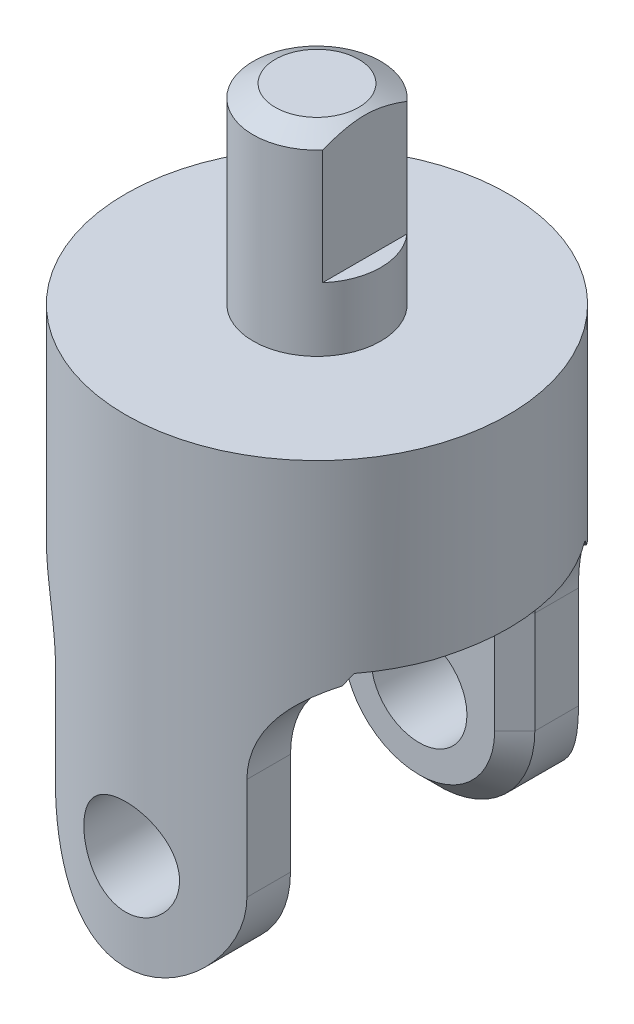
ISO-10303-21;
HEADER;
FILE_DESCRIPTION(('STEP AP214'),'2;1');
FILE_NAME('part.step','',(''),(''),'','','');
FILE_SCHEMA(('AUTOMOTIVE_DESIGN { 1 0 10303 214 1 1 1 1 }'));
ENDSEC;
DATA;
#1=APPLICATION_CONTEXT('core data for automotive mechanical design processes');
#2=APPLICATION_PROTOCOL_DEFINITION('international standard','automotive_design',2000,#1);
#3=PRODUCT_CONTEXT('',#1,'mechanical');
#4=PRODUCT('Part','Part','',(#3));
#5=PRODUCT_RELATED_PRODUCT_CATEGORY('part','',(#4));
#6=PRODUCT_DEFINITION_FORMATION('','',#4);
#7=PRODUCT_DEFINITION_CONTEXT('part definition',#1,'design');
#8=PRODUCT_DEFINITION('design','',#6,#7);
#9=PRODUCT_DEFINITION_SHAPE('','',#8);
#10=(LENGTH_UNIT() NAMED_UNIT(*) SI_UNIT(.MILLI.,.METRE.));
#11=(NAMED_UNIT(*) PLANE_ANGLE_UNIT() SI_UNIT($,.RADIAN.));
#12=(NAMED_UNIT(*) SI_UNIT($,.STERADIAN.) SOLID_ANGLE_UNIT());
#13=UNCERTAINTY_MEASURE_WITH_UNIT(LENGTH_MEASURE(1.E-05),#10,'distance_accuracy_value','');
#14=(GEOMETRIC_REPRESENTATION_CONTEXT(3) GLOBAL_UNCERTAINTY_ASSIGNED_CONTEXT((#13)) GLOBAL_UNIT_ASSIGNED_CONTEXT((#10,
#11,#12)) REPRESENTATION_CONTEXT('',''));
#15=CARTESIAN_POINT('',(0.,0.,0.));
#16=DIRECTION('',(0.,0.,1.));
#17=DIRECTION('',(1.,0.,0.));
#18=AXIS2_PLACEMENT_3D('',#15,#16,#17);
#19=CARTESIAN_POINT('',(0.,66.675,0.));
#20=DIRECTION('',(0.,-1.,0.));
#21=DIRECTION('',(0.,0.,-1.));
#22=AXIS2_PLACEMENT_3D('',#19,#20,#21);
#23=CYLINDRICAL_SURFACE('',#22,6.35);
#24=CARTESIAN_POINT('',(0.,47.625,0.));
#25=DIRECTION('',(0.,1.,0.));
#26=DIRECTION('',(0.,0.,1.));
#27=AXIS2_PLACEMENT_3D('',#24,#25,#26);
#28=CIRCLE('',#27,6.35);
#29=CARTESIAN_POINT('',(0.,47.625,6.35));
#30=VERTEX_POINT('',#29);
#31=EDGE_CURVE('E206',#30,#30,#28,.T.);
#32=ORIENTED_EDGE('',*,*,#31,.T.);
#33=EDGE_LOOP('',(#32));
#34=FACE_BOUND('',#33,.T.);
#35=DIRECTION('',(0.,1.,0.));
#36=VECTOR('',#35,1.);
#37=CARTESIAN_POINT('',(4.7625,53.975,4.20013020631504));
#38=LINE('',#37,#36);
#39=CARTESIAN_POINT('',(4.7625,53.975,4.20013020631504));
#40=VERTEX_POINT('',#39);
#41=CARTESIAN_POINT('',(4.7625,65.405,4.20013020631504));
#42=VERTEX_POINT('',#41);
#43=EDGE_CURVE('E192',#40,#42,#38,.T.);
#44=ORIENTED_EDGE('',*,*,#43,.T.);
#45=CARTESIAN_POINT('',(0.,65.405,0.));
#46=DIRECTION('',(0.,1.,0.));
#47=DIRECTION('',(0.,0.,1.));
#48=AXIS2_PLACEMENT_3D('',#45,#46,#47);
#49=CIRCLE('',#48,6.35);
#50=CARTESIAN_POINT('',(4.7625,65.405,-4.20013020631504));
#51=VERTEX_POINT('',#50);
#52=EDGE_CURVE('E204',#42,#51,#49,.F.);
#53=ORIENTED_EDGE('',*,*,#52,.T.);
#54=DIRECTION('',(0.,1.,0.));
#55=VECTOR('',#54,1.);
#56=CARTESIAN_POINT('',(4.7625,53.975,-4.20013020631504));
#57=LINE('',#56,#55);
#58=CARTESIAN_POINT('',(4.7625,53.975,-4.20013020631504));
#59=VERTEX_POINT('',#58);
#60=EDGE_CURVE('E189',#59,#51,#57,.T.);
#61=ORIENTED_EDGE('',*,*,#60,.F.);
#62=CARTESIAN_POINT('',(0.,53.975,0.));
#63=DIRECTION('',(0.,1.,0.));
#64=DIRECTION('',(0.,0.,1.));
#65=AXIS2_PLACEMENT_3D('',#62,#63,#64);
#66=CIRCLE('',#65,6.35);
#67=EDGE_CURVE('E196',#40,#59,#66,.T.);
#68=ORIENTED_EDGE('',*,*,#67,.F.);
#69=EDGE_LOOP('',(#44,#53,#61,#68));
#70=FACE_BOUND('',#69,.T.);
#71=ADVANCED_FACE('F34',(#34,#70),#23,.T.);
#72=CARTESIAN_POINT('',(0.,66.675,0.));
#73=DIRECTION('',(0.,-1.,0.));
#74=DIRECTION('',(0.,0.,-1.));
#75=AXIS2_PLACEMENT_3D('',#72,#73,#74);
#76=CONICAL_SURFACE('',#75,4.15029547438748,1.0471975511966);
#77=CARTESIAN_POINT('',(0.,66.675,0.));
#78=DIRECTION('',(0.,1.,0.));
#79=DIRECTION('',(0.,0.,1.));
#80=AXIS2_PLACEMENT_3D('',#77,#78,#79);
#81=CIRCLE('',#80,4.15029547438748);
#82=CARTESIAN_POINT('',(0.,66.675,4.15029547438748));
#83=VERTEX_POINT('',#82);
#84=EDGE_CURVE('E383',#83,#83,#81,.T.);
#85=ORIENTED_EDGE('',*,*,#84,.F.);
#86=EDGE_LOOP('',(#85));
#87=FACE_BOUND('',#86,.T.);
#88=ORIENTED_EDGE('',*,*,#52,.F.);
#89=CARTESIAN_POINT('',(4.7625,63.3576640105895,-8.67474438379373));
#90=CARTESIAN_POINT('',(4.7625,63.469711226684,-8.45330719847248));
#91=CARTESIAN_POINT('',(4.7625,63.5810014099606,-8.23148237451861));
#92=CARTESIAN_POINT('',(4.7625,63.8016576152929,-7.7868546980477));
#93=CARTESIAN_POINT('',(4.7625,63.9110234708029,-7.56405176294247));
#94=CARTESIAN_POINT('',(4.7625,64.1277386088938,-7.11660713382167));
#95=CARTESIAN_POINT('',(4.7625,64.2350805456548,-6.89196187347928));
#96=CARTESIAN_POINT('',(4.7625,64.4468042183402,-6.4412857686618));
#97=CARTESIAN_POINT('',(4.7625,64.551186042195,-6.21525496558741));
#98=CARTESIAN_POINT('',(4.7625,64.761300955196,-5.75026984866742));
#99=CARTESIAN_POINT('',(4.7625,64.8668450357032,-5.51122979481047));
#100=CARTESIAN_POINT('',(4.7625,65.0726380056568,-5.03084667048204));
#101=CARTESIAN_POINT('',(4.7625,65.1728864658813,-4.78950341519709));
#102=CARTESIAN_POINT('',(4.7625,65.3663272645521,-4.30430471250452));
#103=CARTESIAN_POINT('',(4.7625,65.4595275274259,-4.06045244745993));
#104=CARTESIAN_POINT('',(4.7625,65.6367537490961,-3.56945984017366));
#105=CARTESIAN_POINT('',(4.7625,65.7207816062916,-3.32232019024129));
#106=CARTESIAN_POINT('',(4.7625,65.8759823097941,-2.82653408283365));
#107=CARTESIAN_POINT('',(4.7625,65.9472687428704,-2.57792372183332));
#108=CARTESIAN_POINT('',(4.7625,66.0743145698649,-2.07671605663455));
#109=CARTESIAN_POINT('',(4.7625,66.1300751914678,-1.82411906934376));
#110=CARTESIAN_POINT('',(4.7625,66.2212225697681,-1.31963718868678));
#111=CARTESIAN_POINT('',(4.7625,66.2569437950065,-1.06781500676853));
#112=CARTESIAN_POINT('',(4.7625,66.2938959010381,-0.688501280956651));
#113=CARTESIAN_POINT('',(4.7625,66.3034417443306,-0.561789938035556));
#114=CARTESIAN_POINT('',(4.7625,66.3167609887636,-0.308068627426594));
#115=CARTESIAN_POINT('',(4.7625,66.3205349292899,-0.181058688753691));
#116=CARTESIAN_POINT('',(4.7625,66.3223134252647,0.0905838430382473));
#117=CARTESIAN_POINT('',(4.7625,66.3194472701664,0.235222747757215));
#118=CARTESIAN_POINT('',(4.7625,66.3061907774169,0.524155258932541));
#119=CARTESIAN_POINT('',(4.7625,66.2958001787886,0.668448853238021));
#120=CARTESIAN_POINT('',(4.7625,66.2678495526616,0.956362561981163));
#121=CARTESIAN_POINT('',(4.7625,66.2502880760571,1.09998253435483));
#122=CARTESIAN_POINT('',(4.7625,66.2085467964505,1.38625029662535));
#123=CARTESIAN_POINT('',(4.7625,66.18436689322,1.52889807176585));
#124=CARTESIAN_POINT('',(4.7625,66.1293852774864,1.81654493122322));
#125=CARTESIAN_POINT('',(4.7625,66.0984351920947,1.96151543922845));
#126=CARTESIAN_POINT('',(4.7625,66.0310411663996,2.25016667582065));
#127=CARTESIAN_POINT('',(4.7625,65.9945971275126,2.39384738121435));
#128=CARTESIAN_POINT('',(4.7625,65.9169451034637,2.67992954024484));
#129=CARTESIAN_POINT('',(4.7625,65.8757364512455,2.82233081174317));
#130=CARTESIAN_POINT('',(4.7625,65.7892365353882,3.10586895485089));
#131=CARTESIAN_POINT('',(4.7625,65.7439455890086,3.24700592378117));
#132=CARTESIAN_POINT('',(4.7625,65.6406667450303,3.55563142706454));
#133=CARTESIAN_POINT('',(4.7625,65.5819291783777,3.72286847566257));
#134=CARTESIAN_POINT('',(4.7625,65.4603269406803,4.05584009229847));
#135=CARTESIAN_POINT('',(4.7625,65.3974619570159,4.22157454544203));
#136=CARTESIAN_POINT('',(4.7625,65.2037410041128,4.71688299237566));
#137=CARTESIAN_POINT('',(4.7625,65.0677927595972,5.04446416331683));
#138=CARTESIAN_POINT('',(4.7625,64.7863691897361,5.69594921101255));
#139=CARTESIAN_POINT('',(4.7625,64.6408818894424,6.01984784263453));
#140=CARTESIAN_POINT('',(4.7625,64.3432582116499,6.66450132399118));
#141=CARTESIAN_POINT('',(4.7625,64.1911228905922,6.98525666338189));
#142=CARTESIAN_POINT('',(4.7625,63.8813253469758,7.62580230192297));
#143=CARTESIAN_POINT('',(4.7625,63.7236419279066,7.9455823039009));
#144=CARTESIAN_POINT('',(4.7625,63.4046196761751,8.58332268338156));
#145=CARTESIAN_POINT('',(4.7625,63.2432807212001,8.90128299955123));
#146=CARTESIAN_POINT('',(4.7625,62.9179416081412,9.53554216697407));
#147=CARTESIAN_POINT('',(4.7625,62.7539434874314,9.85184206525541));
#148=CARTESIAN_POINT('',(4.7625,62.4237848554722,10.4833121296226));
#149=CARTESIAN_POINT('',(4.7625,62.257624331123,10.7984822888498));
#150=CARTESIAN_POINT('',(4.7625,61.8068664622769,11.6479048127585));
#151=CARTESIAN_POINT('',(4.7625,61.5206664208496,12.181306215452));
#152=CARTESIAN_POINT('',(4.7625,60.9448108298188,13.2463803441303));
#153=CARTESIAN_POINT('',(4.7625,60.6551545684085,13.7780526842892));
#154=CARTESIAN_POINT('',(4.7625,60.0757028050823,14.8358326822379));
#155=CARTESIAN_POINT('',(4.7625,59.7859267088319,15.3619509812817));
#156=CARTESIAN_POINT('',(4.7625,59.2046035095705,16.4130517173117));
#157=CARTESIAN_POINT('',(4.7625,58.9130568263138,16.9380343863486));
#158=CARTESIAN_POINT('',(4.7625,58.620879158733,17.4626628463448));
#159=B_SPLINE_CURVE_WITH_KNOTS('',3,(#89,#90,#91,#92,#93,#94,#95,#96,#97,#98,#99,#100,#101,#102,
#103,#104,#105,#106,#107,#108,#109,#110,#111,#112,#113,#114,#115,#116,#117,#118,#119,#120,#121,
#122,#123,#124,#125,#126,#127,#128,#129,#130,#131,#132,#133,#134,#135,#136,#137,#138,#139,#140,
#141,#142,#143,#144,#145,#146,#147,#148,#149,#150,#151,#152,#153,#154,#155,#156,#157,#158),
.UNSPECIFIED.,.F.,.F.,(4,2,2,2,2,2,2,2,2,2,2,2,2,2,2,2,2,2,2,2,2,2,2,2,2,2,2,2,2,2,2,2,2,2,4),
(0.,0.744518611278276,1.48910134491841,2.23600427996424,2.98288500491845,3.76674752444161,
4.55067348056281,5.33370452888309,6.11657320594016,6.89207080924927,7.66750707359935,
8.42958338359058,8.81068147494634,9.19174395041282,9.6255420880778,10.0593552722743,
10.4932561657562,10.927163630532,11.3717539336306,11.8163522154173,12.2610128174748,
12.7056388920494,13.2373268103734,13.7690550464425,14.8328219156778,15.8979507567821,
16.9629109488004,18.0325121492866,19.102149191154,20.1710021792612,21.2398616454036,
23.0558392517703,24.8721975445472,26.6741189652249,28.4756286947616),.UNSPECIFIED.);
#160=EDGE_CURVE('E389',#42,#51,#159,.F.);
#161=ORIENTED_EDGE('',*,*,#160,.T.);
#162=EDGE_LOOP('',(#88,#161));
#163=FACE_BOUND('',#162,.T.);
#164=ADVANCED_FACE('F319',(#87,#163),#76,.T.);
#165=CARTESIAN_POINT('',(0.,47.625,0.));
#166=DIRECTION('',(0.,1.,0.));
#167=DIRECTION('',(0.,0.,1.));
#168=AXIS2_PLACEMENT_3D('',#165,#166,#167);
#169=PLANE('',#168);
#170=CARTESIAN_POINT('',(0.,47.625,0.));
#171=DIRECTION('',(0.,1.,0.));
#172=DIRECTION('',(0.,0.,1.));
#173=AXIS2_PLACEMENT_3D('',#170,#171,#172);
#174=CIRCLE('',#173,19.05);
#175=CARTESIAN_POINT('',(0.,47.625,19.05));
#176=VERTEX_POINT('',#175);
#177=EDGE_CURVE('E418',#176,#176,#174,.T.);
#178=ORIENTED_EDGE('',*,*,#177,.T.);
#179=EDGE_LOOP('',(#178));
#180=FACE_BOUND('',#179,.T.);
#181=ORIENTED_EDGE('',*,*,#31,.F.);
#182=EDGE_LOOP('',(#181));
#183=FACE_BOUND('',#182,.T.);
#184=ADVANCED_FACE('F341',(#180,#183),#169,.T.);
#185=CARTESIAN_POINT('',(0.,47.625,0.));
#186=DIRECTION('',(0.,-1.,0.));
#187=DIRECTION('',(0.,0.,-1.));
#188=AXIS2_PLACEMENT_3D('',#185,#186,#187);
#189=CYLINDRICAL_SURFACE('',#188,19.05);
#190=CARTESIAN_POINT('',(0.,14.2875,-19.05));
#191=CARTESIAN_POINT('',(-0.263131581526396,14.2874926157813,-19.0499955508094));
#192=CARTESIAN_POINT('',(-0.526345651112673,14.2656193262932,-19.0444938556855));
#193=CARTESIAN_POINT('',(-1.04523007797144,14.1788351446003,-19.0230796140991));
#194=CARTESIAN_POINT('',(-1.3008960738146,14.1138998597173,-19.0071611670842));
#195=CARTESIAN_POINT('',(-1.79711626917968,13.9432053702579,-18.966676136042));
#196=CARTESIAN_POINT('',(-2.03768821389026,13.837495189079,-18.9421199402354));
#197=CARTESIAN_POINT('',(-2.49768401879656,13.5884240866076,-18.886974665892));
#198=CARTESIAN_POINT('',(-2.71710716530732,13.4450618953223,-18.8563853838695));
#199=CARTESIAN_POINT('',(-3.13309611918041,13.121637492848,-18.7917903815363));
#200=CARTESIAN_POINT('',(-3.32916431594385,12.940945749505,-18.757731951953));
#201=CARTESIAN_POINT('',(-3.68855284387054,12.5493392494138,-18.6903874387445));
#202=CARTESIAN_POINT('',(-3.85186947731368,12.3384210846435,-18.6571014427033));
#203=CARTESIAN_POINT('',(-4.14345927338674,11.8884851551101,-18.5945391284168));
#204=CARTESIAN_POINT('',(-4.27117578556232,11.6490964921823,-18.5653297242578));
#205=CARTESIAN_POINT('',(-4.48436018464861,11.1513987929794,-18.514996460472));
#206=CARTESIAN_POINT('',(-4.56983482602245,10.8930927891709,-18.4938713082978));
#207=CARTESIAN_POINT('',(-4.69441160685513,10.3703643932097,-18.4626401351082));
#208=CARTESIAN_POINT('',(-4.73440845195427,10.1061682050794,-18.4523218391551));
#209=CARTESIAN_POINT('',(-4.76968113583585,9.57462979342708,-18.443237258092));
#210=CARTESIAN_POINT('',(-4.7649642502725,9.30728808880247,-18.4444690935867));
#211=CARTESIAN_POINT('',(-4.71165721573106,8.78390481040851,-18.4581547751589));
#212=CARTESIAN_POINT('',(-4.66413323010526,8.52774640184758,-18.4703359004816));
#213=CARTESIAN_POINT('',(-4.528261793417,8.02715866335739,-18.5041130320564));
#214=CARTESIAN_POINT('',(-4.43991143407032,7.78273017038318,-18.5257097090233));
#215=CARTESIAN_POINT('',(-4.22398659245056,7.30968179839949,-18.5761348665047));
#216=CARTESIAN_POINT('',(-4.09602516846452,7.08124640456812,-18.6050341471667));
#217=CARTESIAN_POINT('',(-3.80478117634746,6.6487080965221,-18.6667683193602));
#218=CARTESIAN_POINT('',(-3.64149242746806,6.44460944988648,-18.6996038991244));
#219=CARTESIAN_POINT('',(-3.27870637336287,6.06042852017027,-18.7666592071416));
#220=CARTESIAN_POINT('',(-3.07830936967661,5.88119699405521,-18.8008917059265));
#221=CARTESIAN_POINT('',(-2.64989283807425,5.55872255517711,-18.8660394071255));
#222=CARTESIAN_POINT('',(-2.42187246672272,5.41548074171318,-18.8969545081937));
#223=CARTESIAN_POINT('',(-1.94346794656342,5.16873938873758,-18.9521379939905));
#224=CARTESIAN_POINT('',(-1.69300967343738,5.06537804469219,-18.9763831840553));
#225=CARTESIAN_POINT('',(-1.17753132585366,4.90246255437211,-19.0153263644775));
#226=CARTESIAN_POINT('',(-0.912514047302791,4.84290002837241,-19.0300261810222));
#227=CARTESIAN_POINT('',(-0.382714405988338,4.77057222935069,-19.0479521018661));
#228=CARTESIAN_POINT('',(-0.11809958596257,4.75664839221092,-19.0514621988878));
#229=CARTESIAN_POINT('',(0.409679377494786,4.77281558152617,-19.0474220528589));
#230=CARTESIAN_POINT('',(0.67284364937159,4.80290264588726,-19.0398728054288));
#231=CARTESIAN_POINT('',(1.18622530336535,4.90528263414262,-19.0147442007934));
#232=CARTESIAN_POINT('',(1.43657675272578,4.97694351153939,-18.9973151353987));
#233=CARTESIAN_POINT('',(1.92169190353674,5.15971499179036,-18.9543914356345));
#234=CARTESIAN_POINT('',(2.15645402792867,5.27082957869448,-18.928895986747));
#235=CARTESIAN_POINT('',(2.60833595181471,5.5315997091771,-18.8719875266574));
#236=CARTESIAN_POINT('',(2.82506877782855,5.6819041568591,-18.8404775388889));
#237=CARTESIAN_POINT('',(3.23064699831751,6.015957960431,-18.7751881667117));
#238=CARTESIAN_POINT('',(3.41948756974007,6.19971308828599,-18.7414083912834));
#239=CARTESIAN_POINT('',(3.76869505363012,6.60083122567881,-18.6743643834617));
#240=CARTESIAN_POINT('',(3.92824927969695,6.81890845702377,-18.6411331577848));
#241=CARTESIAN_POINT('',(4.20849665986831,7.27942611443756,-18.5798738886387));
#242=CARTESIAN_POINT('',(4.32919153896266,7.5218654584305,-18.5518456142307));
#243=CARTESIAN_POINT('',(4.5273957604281,8.02292566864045,-18.5044745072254));
#244=CARTESIAN_POINT('',(4.60516095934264,8.28144021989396,-18.4850803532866));
#245=CARTESIAN_POINT('',(4.71597247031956,8.80843310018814,-18.457124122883));
#246=CARTESIAN_POINT('',(4.7490285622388,9.0769092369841,-18.4485596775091));
#247=CARTESIAN_POINT('',(4.76897252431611,9.6079342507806,-18.4434131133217));
#248=CARTESIAN_POINT('',(4.75715932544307,9.87043185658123,-18.4464938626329));
#249=CARTESIAN_POINT('',(4.69067285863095,10.3895648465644,-18.4635111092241));
#250=CARTESIAN_POINT('',(4.63600045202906,10.6462003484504,-18.4774473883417));
#251=CARTESIAN_POINT('',(4.48605693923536,11.1449118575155,-18.5144175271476));
#252=CARTESIAN_POINT('',(4.39102945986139,11.3870654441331,-18.5373967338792));
#253=CARTESIAN_POINT('',(4.1632661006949,11.8521650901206,-18.5898712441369));
#254=CARTESIAN_POINT('',(4.03052499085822,12.0751084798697,-18.6193674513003));
#255=CARTESIAN_POINT('',(3.72703010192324,12.5017359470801,-18.6825138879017));
#256=CARTESIAN_POINT('',(3.5553750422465,12.7047659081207,-18.7162524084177));
#257=CARTESIAN_POINT('',(3.18068125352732,13.0795618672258,-18.7835548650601));
#258=CARTESIAN_POINT('',(2.97763508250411,13.2513204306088,-18.8171187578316));
#259=CARTESIAN_POINT('',(2.54148458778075,13.5617309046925,-18.8810155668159));
#260=CARTESIAN_POINT('',(2.30790249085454,13.6997268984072,-18.911278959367));
#261=CARTESIAN_POINT('',(1.82011973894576,13.9342731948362,-18.9644313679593));
#262=CARTESIAN_POINT('',(1.56593401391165,14.0308531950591,-18.9873256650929));
#263=CARTESIAN_POINT('',(1.09350255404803,14.1654905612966,-19.0197758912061));
#264=CARTESIAN_POINT('',(0.877507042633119,14.2111451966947,-19.031032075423));
#265=CARTESIAN_POINT('',(0.441026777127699,14.2721518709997,-19.0461457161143));
#266=CARTESIAN_POINT('',(0.220542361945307,14.2875061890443,-19.0500037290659));
#267=CARTESIAN_POINT('',(0.,14.2875,-19.05));
#268=B_SPLINE_CURVE_WITH_KNOTS('',3,(#190,#191,#192,#193,#194,#195,#196,#197,#198,#199,#200,
#201,#202,#203,#204,#205,#206,#207,#208,#209,#210,#211,#212,#213,#214,#215,#216,#217,#218,#219,
#220,#221,#222,#223,#224,#225,#226,#227,#228,#229,#230,#231,#232,#233,#234,#235,#236,#237,#238,
#239,#240,#241,#242,#243,#244,#245,#246,#247,#248,#249,#250,#251,#252,#253,#254,#255,#256,#257,
#258,#259,#260,#261,#262,#263,#264,#265,#266,#267),.UNSPECIFIED.,.T.,.F.,(4,2,2,2,2,2,2,2,2,2,2,
2,2,2,2,2,2,2,2,2,2,2,2,2,2,2,2,2,2,2,2,2,2,2,2,2,2,2,4),(0.,0.788586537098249,1.57762015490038,
2.36570806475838,3.15382256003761,3.95650832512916,4.75928466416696,5.57398705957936,
6.38855914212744,7.18681236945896,7.98493571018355,8.76371428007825,9.54254833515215,
10.3292442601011,11.1160779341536,11.9253476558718,12.7346420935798,13.5467162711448,
14.3586350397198,15.1497763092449,15.940846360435,16.7201937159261,17.4996197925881,
18.2928764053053,19.08627002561,19.8991381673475,20.7119702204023,21.5199040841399,
22.3276611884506,23.1122150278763,23.8967531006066,24.6766207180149,25.4565965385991,
26.2569190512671,27.0574315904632,27.8724418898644,28.6868668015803,29.3478662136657,
30.008815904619),.UNSPECIFIED.);
#269=CARTESIAN_POINT('',(0.,14.2875,-19.05));
#270=VERTEX_POINT('',#269);
#271=EDGE_CURVE('E222',#270,#270,#268,.T.);
#272=ORIENTED_EDGE('',*,*,#271,.T.);
#273=EDGE_LOOP('',(#272));
#274=FACE_BOUND('',#273,.T.);
#275=CARTESIAN_POINT('',(4.7625,9.525,18.4450831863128));
#276=CARTESIAN_POINT('',(4.7624925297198,9.26201331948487,18.4450882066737));
#277=CARTESIAN_POINT('',(4.74064249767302,8.99894396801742,18.4507690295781));
#278=CARTESIAN_POINT('',(4.65395905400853,8.48035976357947,18.4728204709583));
#279=CARTESIAN_POINT('',(4.58910062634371,8.22484939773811,18.4891973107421));
#280=CARTESIAN_POINT('',(4.41863073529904,7.72895925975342,18.5306727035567));
#281=CARTESIAN_POINT('',(4.31307188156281,7.48856041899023,18.5557599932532));
#282=CARTESIAN_POINT('',(4.06435777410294,7.02885782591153,18.6118155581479));
#283=CARTESIAN_POINT('',(3.92120092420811,6.80955496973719,18.6427840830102));
#284=CARTESIAN_POINT('',(3.59798955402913,6.39344356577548,18.7078756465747));
#285=CARTESIAN_POINT('',(3.41725927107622,6.19716769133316,18.7420490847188));
#286=CARTESIAN_POINT('',(3.02548683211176,5.83737454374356,18.8092627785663));
#287=CARTESIAN_POINT('',(2.81444184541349,5.67386033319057,18.8423029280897));
#288=CARTESIAN_POINT('',(2.36438160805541,5.38205273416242,18.9040849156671));
#289=CARTESIAN_POINT('',(2.12501716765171,5.25428263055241,18.9327603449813));
#290=CARTESIAN_POINT('',(1.62737136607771,5.04099262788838,18.98200696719));
#291=CARTESIAN_POINT('',(1.36909280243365,4.95546649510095,19.0025793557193));
#292=CARTESIAN_POINT('',(0.846503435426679,4.8307983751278,19.0329456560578));
#293=CARTESIAN_POINT('',(0.582420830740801,4.79075182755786,19.0429494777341));
#294=CARTESIAN_POINT('',(0.0511089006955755,4.75534028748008,19.0517829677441));
#295=CARTESIAN_POINT('',(-0.216119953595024,4.75996868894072,19.0506142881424));
#296=CARTESIAN_POINT('',(-0.739865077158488,4.81312508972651,19.0373907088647));
#297=CARTESIAN_POINT('',(-0.996487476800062,4.86067669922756,19.0255779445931));
#298=CARTESIAN_POINT('',(-1.4979884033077,4.99676026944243,18.992675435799));
#299=CARTESIAN_POINT('',(-1.74286630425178,5.08529441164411,18.9715851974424));
#300=CARTESIAN_POINT('',(-2.21649942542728,5.30161989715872,18.9221270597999));
#301=CARTESIAN_POINT('',(-2.44508897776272,5.42975872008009,18.8936951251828));
#302=CARTESIAN_POINT('',(-2.87786265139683,5.72139256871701,18.8326376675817));
#303=CARTESIAN_POINT('',(-3.08204251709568,5.88489374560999,18.8000114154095));
#304=CARTESIAN_POINT('',(-3.46602384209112,6.24784515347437,18.733078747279));
#305=CARTESIAN_POINT('',(-3.6450159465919,6.44814856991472,18.6987507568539));
#306=CARTESIAN_POINT('',(-3.96704999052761,6.87628794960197,18.6330915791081));
#307=CARTESIAN_POINT('',(-4.11009024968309,7.10412519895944,18.6017605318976));
#308=CARTESIAN_POINT('',(-4.35667846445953,7.58245251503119,18.5455654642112));
#309=CARTESIAN_POINT('',(-4.46003156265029,7.8330470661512,18.5207335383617));
#310=CARTESIAN_POINT('',(-4.6228902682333,8.34882531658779,18.4807600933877));
#311=CARTESIAN_POINT('',(-4.68240525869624,8.61400588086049,18.4656165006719));
#312=CARTESIAN_POINT('',(-4.75455546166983,9.14392285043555,18.4471695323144));
#313=CARTESIAN_POINT('',(-4.76838735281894,9.40848599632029,18.4435639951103));
#314=CARTESIAN_POINT('',(-4.75205486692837,9.93614078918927,18.4477788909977));
#315=CARTESIAN_POINT('',(-4.72189453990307,10.1992325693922,18.4555982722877));
#316=CARTESIAN_POINT('',(-4.61948300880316,10.7120326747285,18.4814924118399));
#317=CARTESIAN_POINT('',(-4.54792855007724,10.9618895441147,18.4993972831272));
#318=CARTESIAN_POINT('',(-4.36553244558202,11.4460619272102,18.5432836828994));
#319=CARTESIAN_POINT('',(-4.25468614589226,11.6803755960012,18.5692661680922));
#320=CARTESIAN_POINT('',(-3.99434812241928,12.1318806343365,18.6270164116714));
#321=CARTESIAN_POINT('',(-3.84414094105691,12.3486459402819,18.6588876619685));
#322=CARTESIAN_POINT('',(-3.51024964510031,12.7543338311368,18.7245704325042));
#323=CARTESIAN_POINT('',(-3.3265600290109,12.9432518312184,18.7583822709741));
#324=CARTESIAN_POINT('',(-2.92542620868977,13.2927300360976,18.8251605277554));
#325=CARTESIAN_POINT('',(-2.70725242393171,13.4524624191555,18.8580846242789));
#326=CARTESIAN_POINT('',(-2.24648402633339,13.7330228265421,18.9185019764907));
#327=CARTESIAN_POINT('',(-2.00389068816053,13.8538528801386,18.9459955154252));
#328=CARTESIAN_POINT('',(-1.50284593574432,14.0521296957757,18.9922807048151));
#329=CARTESIAN_POINT('',(-1.24452402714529,14.1298884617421,19.0111347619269));
#330=CARTESIAN_POINT('',(-0.717945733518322,14.240751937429,19.0382898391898));
#331=CARTESIAN_POINT('',(-0.449691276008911,14.2738652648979,19.0465928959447));
#332=CARTESIAN_POINT('',(0.0813602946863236,14.2940131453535,19.0516273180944));
#333=CARTESIAN_POINT('',(0.344108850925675,14.2822693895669,19.0486654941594));
#334=CARTESIAN_POINT('',(0.863762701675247,14.2158347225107,19.0321833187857));
#335=CARTESIAN_POINT('',(1.12066816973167,14.1611450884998,19.0186632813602));
#336=CARTESIAN_POINT('',(1.62006455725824,14.0110263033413,18.9826312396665));
#337=CARTESIAN_POINT('',(1.86262563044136,13.9158180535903,18.9601680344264));
#338=CARTESIAN_POINT('',(2.32846746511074,13.6875651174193,18.908615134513));
#339=CARTESIAN_POINT('',(2.55174579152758,13.5545156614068,18.8795246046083));
#340=CARTESIAN_POINT('',(2.97847668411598,13.2506311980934,18.8169827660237));
#341=CARTESIAN_POINT('',(3.18132613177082,13.0789673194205,18.7834436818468));
#342=CARTESIAN_POINT('',(3.55575403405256,12.7043361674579,18.7161796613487));
#343=CARTESIAN_POINT('',(3.72732454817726,12.5013609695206,18.6824546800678));
#344=CARTESIAN_POINT('',(4.0374666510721,12.0653107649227,18.6179210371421));
#345=CARTESIAN_POINT('',(4.1753628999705,11.831744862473,18.5871785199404));
#346=CARTESIAN_POINT('',(4.4097268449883,11.3440107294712,18.5329808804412));
#347=CARTESIAN_POINT('',(4.50622468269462,11.0898576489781,18.5095204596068));
#348=CARTESIAN_POINT('',(4.6406872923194,10.617626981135,18.4762096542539));
#349=CARTESIAN_POINT('',(4.68626747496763,10.401808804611,18.4646250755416));
#350=CARTESIAN_POINT('',(4.74717566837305,9.96567951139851,18.4490600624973));
#351=CARTESIAN_POINT('',(4.76250625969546,9.74536877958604,18.4450789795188));
#352=CARTESIAN_POINT('',(4.7625,9.525,18.4450831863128));
#353=B_SPLINE_CURVE_WITH_KNOTS('',3,(#275,#276,#277,#278,#279,#280,#281,#282,#283,#284,#285,
#286,#287,#288,#289,#290,#291,#292,#293,#294,#295,#296,#297,#298,#299,#300,#301,#302,#303,#304,
#305,#306,#307,#308,#309,#310,#311,#312,#313,#314,#315,#316,#317,#318,#319,#320,#321,#322,#323,
#324,#325,#326,#327,#328,#329,#330,#331,#332,#333,#334,#335,#336,#337,#338,#339,#340,#341,#342,
#343,#344,#345,#346,#347,#348,#349,#350,#351,#352),.UNSPECIFIED.,.T.,.F.,(4,2,2,2,2,2,2,2,2,2,2,
2,2,2,2,2,2,2,2,2,2,2,2,2,2,2,2,2,2,2,2,2,2,2,2,2,2,2,4),(0.,0.788150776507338,1.57676038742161,
2.36435403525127,3.15198112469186,3.95523632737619,4.75856658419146,5.57310600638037,
6.3875251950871,7.18544570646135,7.98324823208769,8.76334790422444,9.54348910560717,
10.3306792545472,11.1180064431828,11.9266423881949,12.7353161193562,13.5479110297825,
14.3603319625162,15.1512950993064,15.9421854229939,16.7201355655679,17.4981778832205,
18.2914832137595,19.0849190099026,19.8982075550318,20.7114536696,21.5187289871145,
22.3258484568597,23.1111446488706,23.896417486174,24.677462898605,25.4586067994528,
26.258464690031,27.0585253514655,27.8735118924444,28.6879040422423,29.3483886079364,
30.0088168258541),.UNSPECIFIED.);
#354=CARTESIAN_POINT('',(4.7625,9.525,18.4450831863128));
#355=VERTEX_POINT('',#354);
#356=EDGE_CURVE('E215',#355,#355,#353,.T.);
#357=ORIENTED_EDGE('',*,*,#356,.T.);
#358=EDGE_LOOP('',(#357));
#359=FACE_BOUND('',#358,.T.);
#360=ORIENTED_EDGE('',*,*,#177,.F.);
#361=EDGE_LOOP('',(#360));
#362=FACE_BOUND('',#361,.T.);
#363=CARTESIAN_POINT('',(-14.6641365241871,28.1401656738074,-12.16));
#364=CARTESIAN_POINT('',(-14.7095591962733,28.2254333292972,-12.105224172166));
#365=CARTESIAN_POINT('',(-14.75498605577,28.3102920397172,-12.04981700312));
#366=CARTESIAN_POINT('',(-14.8457641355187,28.4792277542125,-11.9377962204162));
#367=CARTESIAN_POINT('',(-14.8911153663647,28.5633048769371,-11.8811827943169));
#368=CARTESIAN_POINT('',(-14.981671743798,28.7307389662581,-11.7667894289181));
#369=CARTESIAN_POINT('',(-15.0268768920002,28.8140959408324,-11.7090095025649));
#370=CARTESIAN_POINT('',(-15.1170787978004,28.9801520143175,-11.5923195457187));
#371=CARTESIAN_POINT('',(-15.1620755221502,29.0628510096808,-11.5334093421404));
#372=CARTESIAN_POINT('',(-15.2069296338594,29.1452388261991,-11.4739614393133));
#373=B_SPLINE_CURVE_WITH_KNOTS('',3,(#363,#364,#365,#366,#367,#368,#369,#370,#371,#372),
.UNSPECIFIED.,.F.,.F.,(4,2,2,2,4),(0.,0.333174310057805,0.666297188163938,0.999416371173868,
1.33258698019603),.UNSPECIFIED.);
#374=CARTESIAN_POINT('',(-14.6641365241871,28.1401656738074,-12.16));
#375=VERTEX_POINT('',#374);
#376=CARTESIAN_POINT('',(-15.2069296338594,29.1452388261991,-11.4739614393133));
#377=VERTEX_POINT('',#376);
#378=EDGE_CURVE('E305',#375,#377,#373,.T.);
#379=ORIENTED_EDGE('',*,*,#378,.T.);
#380=CARTESIAN_POINT('',(0.,29.1452388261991,0.));
#381=DIRECTION('',(0.,1.,0.));
#382=DIRECTION('',(0.,0.,1.));
#383=AXIS2_PLACEMENT_3D('',#380,#381,#382);
#384=CIRCLE('',#383,19.05);
#385=CARTESIAN_POINT('',(-17.9411689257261,29.1452388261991,-6.40444826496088));
#386=VERTEX_POINT('',#385);
#387=EDGE_CURVE('E423',#377,#386,#384,.T.);
#388=ORIENTED_EDGE('',*,*,#387,.T.);
#389=CARTESIAN_POINT('',(-9.525,19.685,-16.4977839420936));
#390=CARTESIAN_POINT('',(-9.52496088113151,19.918350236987,-16.4977688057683));
#391=CARTESIAN_POINT('',(-9.53357353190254,20.1516967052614,-16.4928328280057));
#392=CARTESIAN_POINT('',(-9.56782146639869,20.6166980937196,-16.4730087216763));
#393=CARTESIAN_POINT('',(-9.59345572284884,20.8483531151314,-16.4581211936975));
#394=CARTESIAN_POINT('',(-9.66141942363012,21.3080009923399,-16.4183108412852));
#395=CARTESIAN_POINT('',(-9.70372594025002,21.5359984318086,-16.3934017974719));
#396=CARTESIAN_POINT('',(-9.80447669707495,21.9870210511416,-16.3333461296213));
#397=CARTESIAN_POINT('',(-9.86292069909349,22.2100463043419,-16.2981996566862));
#398=CARTESIAN_POINT('',(-9.99521577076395,22.6496636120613,-16.217402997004));
#399=CARTESIAN_POINT('',(-10.0690752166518,22.8662520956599,-16.1717470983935));
#400=CARTESIAN_POINT('',(-10.2311827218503,23.2913603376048,-16.0696785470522));
#401=CARTESIAN_POINT('',(-10.3194309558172,23.4998799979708,-16.0132657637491));
#402=CARTESIAN_POINT('',(-10.5090589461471,23.9073731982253,-15.8894615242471));
#403=CARTESIAN_POINT('',(-10.6104339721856,24.1063501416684,-15.8220740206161));
#404=CARTESIAN_POINT('',(-10.8249101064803,24.4935871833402,-15.676116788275));
#405=CARTESIAN_POINT('',(-10.9380111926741,24.6818473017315,-15.597547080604));
#406=CARTESIAN_POINT('',(-11.1750060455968,25.0476354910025,-15.4286429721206));
#407=CARTESIAN_POINT('',(-11.2989577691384,25.2250961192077,-15.3382439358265));
#408=CARTESIAN_POINT('',(-11.5553164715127,25.5672655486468,-15.1460495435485));
#409=CARTESIAN_POINT('',(-11.6877234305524,25.7319743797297,-15.0442542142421));
#410=CARTESIAN_POINT('',(-11.9591574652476,26.0480960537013,-14.8293967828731));
#411=CARTESIAN_POINT('',(-12.0981857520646,26.1995064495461,-14.7163326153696));
#412=CARTESIAN_POINT('',(-12.3809708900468,26.4887188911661,-14.4792302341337));
#413=CARTESIAN_POINT('',(-12.5247282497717,26.6265194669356,-14.3551908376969));
#414=CARTESIAN_POINT('',(-12.8240785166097,26.8965620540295,-14.0885806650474));
#415=CARTESIAN_POINT('',(-12.9798547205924,27.0279377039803,-13.9453388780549));
#416=CARTESIAN_POINT('',(-13.292575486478,27.2756182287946,-13.6475843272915));
#417=CARTESIAN_POINT('',(-13.4495200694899,27.3919228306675,-13.4930713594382));
#418=CARTESIAN_POINT('',(-13.7627279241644,27.6100750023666,-13.1734537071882));
#419=CARTESIAN_POINT('',(-13.91899104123,27.7119194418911,-13.0083467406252));
#420=CARTESIAN_POINT('',(-14.2291584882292,27.9019462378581,-12.6683290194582));
#421=CARTESIAN_POINT('',(-14.3830623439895,27.9901258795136,-12.4934163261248));
#422=CARTESIAN_POINT('',(-14.7634251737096,28.1948863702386,-12.0444336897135));
#423=CARTESIAN_POINT('',(-14.9875078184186,28.3034922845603,-11.7646791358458));
#424=CARTESIAN_POINT('',(-15.4232003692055,28.4957157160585,-11.1874194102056));
#425=CARTESIAN_POINT('',(-15.6348051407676,28.5793230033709,-10.8899070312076));
#426=CARTESIAN_POINT('',(-16.0431146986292,28.7255421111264,-10.2789237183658));
#427=CARTESIAN_POINT('',(-16.2397846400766,28.7881059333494,-9.96541815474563));
#428=CARTESIAN_POINT('',(-16.615638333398,28.8957388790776,-9.3252837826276));
#429=CARTESIAN_POINT('',(-16.7948218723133,28.9408077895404,-8.99865481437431));
#430=CARTESIAN_POINT('',(-17.1918461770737,29.029905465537,-8.22145899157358));
#431=CARTESIAN_POINT('',(-17.4021973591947,29.0684013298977,-7.76641658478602));
#432=CARTESIAN_POINT('',(-17.786699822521,29.1278564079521,-6.84014068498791));
#433=CARTESIAN_POINT('',(-17.9608394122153,29.1488099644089,-6.36890201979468));
#434=CARTESIAN_POINT('',(-18.2714417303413,29.1794105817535,-5.41378881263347));
#435=CARTESIAN_POINT('',(-18.4079009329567,29.1890565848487,-4.92991309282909));
#436=CARTESIAN_POINT('',(-18.6421466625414,29.2019870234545,-3.95287775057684));
#437=CARTESIAN_POINT('',(-18.7399368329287,29.2052720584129,-3.45971900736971));
#438=CARTESIAN_POINT('',(-18.897358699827,29.2091078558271,-2.4600813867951));
#439=CARTESIAN_POINT('',(-18.9564226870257,29.2096187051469,-1.95351291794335));
#440=CARTESIAN_POINT('',(-19.033752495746,29.2100647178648,-0.937263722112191));
#441=CARTESIAN_POINT('',(-19.0520174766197,29.209999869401,-0.427582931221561));
#442=CARTESIAN_POINT('',(-19.0476285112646,29.2100001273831,0.591825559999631));
#443=CARTESIAN_POINT('',(-19.0249568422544,29.2100652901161,1.10155318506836));
#444=CARTESIAN_POINT('',(-18.9388075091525,29.2094475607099,2.11754548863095));
#445=CARTESIAN_POINT('',(-18.8753295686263,29.2087646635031,2.62381014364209));
#446=CARTESIAN_POINT('',(-18.7036160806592,29.2041086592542,3.65580332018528));
#447=CARTESIAN_POINT('',(-18.5932233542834,29.1999661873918,4.18117378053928));
#448=CARTESIAN_POINT('',(-18.3285057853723,29.1835599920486,5.2207365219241));
#449=CARTESIAN_POINT('',(-18.1741722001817,29.1712946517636,5.73492655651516));
#450=CARTESIAN_POINT('',(-17.8230306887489,29.1322930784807,6.74751648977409));
#451=CARTESIAN_POINT('',(-17.6262637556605,29.1055707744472,7.24593109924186));
#452=CARTESIAN_POINT('',(-17.1921907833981,29.0296619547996,8.22291578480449));
#453=CARTESIAN_POINT('',(-16.9549063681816,28.9804873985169,8.7014962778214));
#454=CARTESIAN_POINT('',(-16.5317482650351,28.8726944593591,9.47232063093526));
#455=CARTESIAN_POINT('',(-16.356505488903,28.8232353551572,9.77172744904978));
#456=CARTESIAN_POINT('',(-15.9915321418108,28.7076409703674,10.3582119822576));
#457=CARTESIAN_POINT('',(-15.8018055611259,28.6415102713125,10.6452930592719));
#458=CARTESIAN_POINT('',(-15.4100602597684,28.4895738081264,11.2048655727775));
#459=CARTESIAN_POINT('',(-15.2080616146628,28.4037995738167,11.4773795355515));
#460=CARTESIAN_POINT('',(-14.794100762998,28.2093882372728,12.0062371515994));
#461=CARTESIAN_POINT('',(-14.5821407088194,28.1007560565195,12.2625842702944));
#462=CARTESIAN_POINT('',(-14.1961331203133,27.8828084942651,12.7059055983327));
#463=CARTESIAN_POINT('',(-14.0232896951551,27.7782615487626,12.8962780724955));
#464=CARTESIAN_POINT('',(-13.6756323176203,27.5516907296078,13.2643740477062));
#465=CARTESIAN_POINT('',(-13.5008188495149,27.4296710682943,13.4421005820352));
#466=CARTESIAN_POINT('',(-13.1516762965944,27.1671845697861,13.7838888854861));
#467=CARTESIAN_POINT('',(-12.9773471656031,27.0267195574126,13.947952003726));
#468=CARTESIAN_POINT('',(-12.6319391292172,26.726763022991,14.2615225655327));
#469=CARTESIAN_POINT('',(-12.4608602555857,26.5672713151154,14.4110298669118));
#470=CARTESIAN_POINT('',(-12.1237135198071,26.2279198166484,14.6958204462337));
#471=CARTESIAN_POINT('',(-11.9576926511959,26.0479167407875,14.8309890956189));
#472=CARTESIAN_POINT('',(-11.6351953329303,25.6689938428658,15.0853214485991));
#473=CARTESIAN_POINT('',(-11.4787191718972,25.4700734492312,15.2044846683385));
#474=CARTESIAN_POINT('',(-11.1784747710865,25.0543983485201,15.4265708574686));
#475=CARTESIAN_POINT('',(-11.0347050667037,24.8376457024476,15.5294956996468));
#476=CARTESIAN_POINT('',(-10.7628059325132,24.3878782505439,15.7191604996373));
#477=CARTESIAN_POINT('',(-10.6346741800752,24.154865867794,15.8059028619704));
#478=CARTESIAN_POINT('',(-10.4115375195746,23.7046522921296,15.9536199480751));
#479=CARTESIAN_POINT('',(-10.3143937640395,23.4891174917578,16.0164604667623));
#480=CARTESIAN_POINT('',(-10.1355425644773,23.04871010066,16.1302361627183));
#481=CARTESIAN_POINT('',(-10.0538339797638,22.8238382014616,16.181172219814));
#482=CARTESIAN_POINT('',(-9.90713729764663,22.3666546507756,16.2714028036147));
#483=CARTESIAN_POINT('',(-9.84213485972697,22.1343495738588,16.3107073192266));
#484=CARTESIAN_POINT('',(-9.72972257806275,21.6640173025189,16.3780123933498));
#485=CARTESIAN_POINT('',(-9.6823065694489,21.4259921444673,16.4060169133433));
#486=CARTESIAN_POINT('',(-9.60449707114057,20.9383691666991,16.4516946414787));
#487=CARTESIAN_POINT('',(-9.57468865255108,20.6886433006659,16.4690135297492));
#488=CARTESIAN_POINT('',(-9.54488066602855,20.3127872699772,16.48629321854));
#489=CARTESIAN_POINT('',(-9.5374287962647,20.1873921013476,16.4906033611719));
#490=CARTESIAN_POINT('',(-9.52748802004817,19.9363374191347,16.4963477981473));
#491=CARTESIAN_POINT('',(-9.52499919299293,19.8106779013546,16.4977820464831));
#492=CARTESIAN_POINT('',(-9.525,19.685,16.4977839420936));
#493=B_SPLINE_CURVE_WITH_KNOTS('',3,(#389,#390,#391,#392,#393,#394,#395,#396,#397,#398,#399,
#400,#401,#402,#403,#404,#405,#406,#407,#408,#409,#410,#411,#412,#413,#414,#415,#416,#417,#418,
#419,#420,#421,#422,#423,#424,#425,#426,#427,#428,#429,#430,#431,#432,#433,#434,#435,#436,#437,
#438,#439,#440,#441,#442,#443,#444,#445,#446,#447,#448,#449,#450,#451,#452,#453,#454,#455,#456,
#457,#458,#459,#460,#461,#462,#463,#464,#465,#466,#467,#468,#469,#470,#471,#472,#473,#474,#475,
#476,#477,#478,#479,#480,#481,#482,#483,#484,#485,#486,#487,#488,#489,#490,#491,#492),
.UNSPECIFIED.,.F.,.F.,(4,2,2,2,2,2,2,2,2,2,2,2,2,2,2,2,2,2,2,2,2,2,2,2,2,2,2,2,2,2,2,2,2,2,2,2,
2,2,2,2,2,2,2,2,2,2,2,2,2,2,2,4),(0.,0.699834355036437,1.39962647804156,2.09845958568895,
2.79728237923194,3.49648588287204,4.19569787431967,4.8946585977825,5.59361800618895,
6.29656980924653,6.99951996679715,7.70259920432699,8.40575429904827,9.15225685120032,
9.89877292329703,10.6454503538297,11.3922759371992,12.514141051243,13.6364646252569,
14.7613310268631,15.8862111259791,17.392458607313,18.899191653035,20.40606563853,
21.9127976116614,23.4411511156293,24.9695361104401,26.4985829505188,28.0276401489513,
29.6362655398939,31.2452112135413,32.852609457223,34.4591525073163,35.50965675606,
36.5598726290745,37.6084144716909,38.6567307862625,39.4886840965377,40.3204371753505,
41.1521080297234,41.9837870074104,42.8216802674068,43.6595988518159,44.4974207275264,
45.3351180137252,46.0680642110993,46.8009562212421,47.5332170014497,48.2652208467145,
49.02034913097,49.3973072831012,49.7742714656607),.UNSPECIFIED.);
#494=CARTESIAN_POINT('',(-17.9411689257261,29.1452388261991,6.40444826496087));
#495=VERTEX_POINT('',#494);
#496=EDGE_CURVE('E372',#386,#495,#493,.T.);
#497=ORIENTED_EDGE('',*,*,#496,.T.);
#498=CARTESIAN_POINT('',(-15.2069296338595,29.1452388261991,11.4739614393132));
#499=VERTEX_POINT('',#498);
#500=EDGE_CURVE('E538',#495,#499,#384,.T.);
#501=ORIENTED_EDGE('',*,*,#500,.T.);
#502=CARTESIAN_POINT('',(-15.2069296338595,29.1452388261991,11.4739614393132));
#503=CARTESIAN_POINT('',(-15.1620755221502,29.0628510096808,11.5334093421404));
#504=CARTESIAN_POINT('',(-15.1170787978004,28.9801520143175,11.5923195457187));
#505=CARTESIAN_POINT('',(-15.0268768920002,28.8140959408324,11.7090095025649));
#506=CARTESIAN_POINT('',(-14.981671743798,28.7307389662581,11.7667894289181));
#507=CARTESIAN_POINT('',(-14.8911153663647,28.5633048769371,11.8811827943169));
#508=CARTESIAN_POINT('',(-14.8457641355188,28.4792277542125,11.9377962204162));
#509=CARTESIAN_POINT('',(-14.75498605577,28.3102920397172,12.04981700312));
#510=CARTESIAN_POINT('',(-14.7095591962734,28.2254333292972,12.105224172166));
#511=CARTESIAN_POINT('',(-14.6641365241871,28.1401656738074,12.16));
#512=B_SPLINE_CURVE_WITH_KNOTS('',3,(#502,#503,#504,#505,#506,#507,#508,#509,#510,#511),
.UNSPECIFIED.,.F.,.F.,(4,2,2,2,4),(0.,0.333170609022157,0.666289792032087,0.99941267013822,
1.33258698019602),.UNSPECIFIED.);
#513=CARTESIAN_POINT('',(-14.6641365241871,28.1401656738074,12.16));
#514=VERTEX_POINT('',#513);
#515=EDGE_CURVE('E289',#499,#514,#512,.T.);
#516=ORIENTED_EDGE('',*,*,#515,.T.);
#517=CARTESIAN_POINT('',(-9.525,19.685,16.4977839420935));
#518=VERTEX_POINT('',#517);
#519=EDGE_CURVE('E373',#514,#518,#493,.T.);
#520=ORIENTED_EDGE('',*,*,#519,.T.);
#521=DIRECTION('',(0.,-1.,0.));
#522=VECTOR('',#521,1.);
#523=CARTESIAN_POINT('',(-9.52499999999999,47.625,16.4977839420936));
#524=LINE('',#523,#522);
#525=CARTESIAN_POINT('',(-9.525,9.525,16.4977839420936));
#526=VERTEX_POINT('',#525);
#527=EDGE_CURVE('E374',#518,#526,#524,.T.);
#528=ORIENTED_EDGE('',*,*,#527,.T.);
#529=CARTESIAN_POINT('',(9.525,9.525,16.4977839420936));
#530=CARTESIAN_POINT('',(9.52500093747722,9.40027257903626,16.4977810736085));
#531=CARTESIAN_POINT('',(9.5225495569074,9.27556275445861,16.4991989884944));
#532=CARTESIAN_POINT('',(9.51275833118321,9.02640408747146,16.504847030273));
#533=CARTESIAN_POINT('',(9.50541869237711,8.90195523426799,16.5090770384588));
#534=CARTESIAN_POINT('',(9.47610793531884,8.52953393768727,16.5259318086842));
#535=CARTESIAN_POINT('',(9.4468449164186,8.28227418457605,16.5427214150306));
#536=CARTESIAN_POINT('',(9.36949132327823,7.79316834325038,16.5866536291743));
#537=CARTESIAN_POINT('',(9.32150961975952,7.55129934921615,16.6137363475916));
#538=CARTESIAN_POINT('',(9.20730560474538,7.07314911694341,16.6772985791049));
#539=CARTESIAN_POINT('',(9.14108119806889,6.83686852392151,16.7137791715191));
#540=CARTESIAN_POINT('',(8.99129510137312,6.37194751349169,16.7948306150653));
#541=CARTESIAN_POINT('',(8.90777526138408,6.14329017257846,16.8393819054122));
#542=CARTESIAN_POINT('',(8.72407711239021,5.69420111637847,16.9352799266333));
#543=CARTESIAN_POINT('',(8.62389244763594,5.47377257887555,16.9866292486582));
#544=CARTESIAN_POINT('',(8.29930376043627,4.82601405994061,17.1488381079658));
#545=CARTESIAN_POINT('',(8.05095104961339,4.41247529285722,17.2678097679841));
#546=CARTESIAN_POINT('',(7.47383610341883,3.59736922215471,17.5257462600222));
#547=CARTESIAN_POINT('',(7.14015861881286,3.19954734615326,17.6655504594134));
#548=CARTESIAN_POINT('',(6.5945742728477,2.64718480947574,17.8732248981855));
#549=CARTESIAN_POINT('',(6.40509661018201,2.47038257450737,17.9421446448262));
#550=CARTESIAN_POINT('',(6.01181385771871,2.13237428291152,18.0777156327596));
#551=CARTESIAN_POINT('',(5.80800671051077,1.97117047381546,18.1443665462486));
#552=CARTESIAN_POINT('',(5.3727806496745,1.65505544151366,18.2781569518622));
#553=CARTESIAN_POINT('',(5.14042653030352,1.50131409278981,18.3450225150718));
#554=CARTESIAN_POINT('',(4.66194023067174,1.21417930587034,18.4724136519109));
#555=CARTESIAN_POINT('',(4.41581396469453,1.08077722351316,18.5329419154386));
#556=CARTESIAN_POINT('',(3.91130485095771,0.835583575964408,18.6459377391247));
#557=CARTESIAN_POINT('',(3.65292491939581,0.723786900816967,18.6984072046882));
#558=CARTESIAN_POINT('',(3.1257193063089,0.523053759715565,18.7937250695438));
#559=CARTESIAN_POINT('',(2.85689473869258,0.434114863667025,18.8365744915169));
#560=CARTESIAN_POINT('',(2.33040396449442,0.2857231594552,18.9086545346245));
#561=CARTESIAN_POINT('',(2.07330466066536,0.224622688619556,18.9386372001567));
#562=CARTESIAN_POINT('',(1.55394863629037,0.123892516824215,18.9883061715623));
#563=CARTESIAN_POINT('',(1.29169214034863,0.0842618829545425,19.0079929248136));
#564=CARTESIAN_POINT('',(0.76432935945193,0.0270138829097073,19.0364912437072));
#565=CARTESIAN_POINT('',(0.499224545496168,0.00938565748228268,19.0453081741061));
#566=CARTESIAN_POINT('',(-0.0316607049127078,-0.00364684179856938,19.0518227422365));
#567=CARTESIAN_POINT('',(-0.297441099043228,0.000947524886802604,19.0495210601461));
#568=CARTESIAN_POINT('',(-0.804260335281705,0.0309220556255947,19.0345541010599));
#569=CARTESIAN_POINT('',(-1.04543822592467,0.0544573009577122,19.0228087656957));
#570=CARTESIAN_POINT('',(-1.52469707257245,0.119714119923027,18.9904047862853));
#571=CARTESIAN_POINT('',(-1.76277824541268,0.161434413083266,18.9697467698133));
#572=CARTESIAN_POINT('',(-2.23423979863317,0.262606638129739,18.9200123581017));
#573=CARTESIAN_POINT('',(-2.46762011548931,0.322058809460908,18.8909358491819));
#574=CARTESIAN_POINT('',(-2.92820911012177,0.458088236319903,18.8250425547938));
#575=CARTESIAN_POINT('',(-3.15541756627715,0.534666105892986,18.7882254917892));
#576=CARTESIAN_POINT('',(-3.60539303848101,0.705394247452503,18.7071268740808));
#577=CARTESIAN_POINT('',(-3.82805781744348,0.799769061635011,18.662750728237));
#578=CARTESIAN_POINT('',(-4.26455258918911,1.00458926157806,18.5678772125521));
#579=CARTESIAN_POINT('',(-4.47837941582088,1.11504034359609,18.51737767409));
#580=CARTESIAN_POINT('',(-5.10493628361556,1.46924131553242,18.3583058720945));
#581=CARTESIAN_POINT('',(-5.50300713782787,1.73594015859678,18.2421108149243));
#582=CARTESIAN_POINT('',(-6.28824042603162,2.35173975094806,17.9874060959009));
#583=CARTESIAN_POINT('',(-6.67082158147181,2.70624414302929,17.8478253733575));
#584=CARTESIAN_POINT('',(-7.19758780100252,3.28095380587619,17.638966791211));
#585=CARTESIAN_POINT('',(-7.36544169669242,3.47985996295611,17.5693768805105));
#586=CARTESIAN_POINT('',(-7.68466910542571,3.89124176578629,17.4321111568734));
#587=CARTESIAN_POINT('',(-7.83604008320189,4.10371949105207,17.3644356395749));
#588=CARTESIAN_POINT('',(-8.13051871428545,4.55533319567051,17.2286143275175));
#589=CARTESIAN_POINT('',(-8.27246277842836,4.79530464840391,17.1607200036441));
#590=CARTESIAN_POINT('',(-8.53533313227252,5.28806294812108,17.0315012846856));
#591=CARTESIAN_POINT('',(-8.65626905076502,5.5408438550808,16.9701738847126));
#592=CARTESIAN_POINT('',(-8.87577538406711,6.05731622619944,16.856404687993));
#593=CARTESIAN_POINT('',(-8.97438588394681,6.32098711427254,16.8039470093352));
#594=CARTESIAN_POINT('',(-9.14827185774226,6.85774586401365,16.7099199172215));
#595=CARTESIAN_POINT('',(-9.22355744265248,7.13082958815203,16.6683457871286));
#596=CARTESIAN_POINT('',(-9.32597272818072,7.57995506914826,16.6111629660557));
#597=CARTESIAN_POINT('',(-9.36056268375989,7.75384156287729,16.5916705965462));
#598=CARTESIAN_POINT('',(-9.42003837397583,8.10374181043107,16.5579753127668));
#599=CARTESIAN_POINT('',(-9.44492679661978,8.27975496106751,16.5437709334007));
#600=CARTESIAN_POINT('',(-9.4848665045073,8.63355937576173,16.5209069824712));
#601=CARTESIAN_POINT('',(-9.49990078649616,8.81135317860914,16.5122569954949));
#602=CARTESIAN_POINT('',(-9.51997579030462,9.16776164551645,16.5006843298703));
#603=CARTESIAN_POINT('',(-9.52501242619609,9.34637661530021,16.4977639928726));
#604=CARTESIAN_POINT('',(-9.525,9.525,16.4977839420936));
#605=B_SPLINE_CURVE_WITH_KNOTS('',3,(#529,#530,#531,#532,#533,#534,#535,#536,#537,#538,#539,
#540,#541,#542,#543,#544,#545,#546,#547,#548,#549,#550,#551,#552,#553,#554,#555,#556,#557,#558,
#559,#560,#561,#562,#563,#564,#565,#566,#567,#568,#569,#570,#571,#572,#573,#574,#575,#576,#577,
#578,#579,#580,#581,#582,#583,#584,#585,#586,#587,#588,#589,#590,#591,#592,#593,#594,#595,#596,
#597,#598,#599,#600,#601,#602,#603,#604),.UNSPECIFIED.,.F.,.F.,(4,2,2,2,2,2,2,2,2,2,2,2,2,2,2,2,
2,2,2,2,2,2,2,2,2,2,2,2,2,2,2,2,2,2,2,2,2,4),(0.,0.374115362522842,0.748214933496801,
1.49577871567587,2.23905786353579,2.98242241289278,3.72400882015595,4.4658787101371,
5.95045512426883,7.55645263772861,8.36024673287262,9.16415647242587,10.0226343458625,
10.8807463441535,11.7386551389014,12.5964726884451,13.3932583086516,14.1900093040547,
14.9863669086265,15.7826757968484,16.5096401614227,17.2365533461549,17.9634763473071,
18.6904254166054,19.4272479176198,20.1643321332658,21.6376476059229,23.250115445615,
24.0576502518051,24.8653090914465,25.725087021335,26.5844698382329,27.4422971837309,
28.2997521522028,28.8345228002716,29.3691451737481,29.9046876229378,30.4404488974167),.UNSPECIFIED.);
#606=CARTESIAN_POINT('',(9.525,9.525,16.4977839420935));
#607=VERTEX_POINT('',#606);
#608=EDGE_CURVE('E477',#607,#526,#605,.T.);
#609=ORIENTED_EDGE('',*,*,#608,.F.);
#610=DIRECTION('',(0.,-1.,0.));
#611=VECTOR('',#610,1.);
#612=CARTESIAN_POINT('',(9.52499999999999,47.625,16.4977839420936));
#613=LINE('',#612,#611);
#614=CARTESIAN_POINT('',(9.525,19.685,16.4977839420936));
#615=VERTEX_POINT('',#614);
#616=EDGE_CURVE('E520',#615,#607,#613,.T.);
#617=ORIENTED_EDGE('',*,*,#616,.F.);
#618=CARTESIAN_POINT('',(9.525,19.685,-16.4977839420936));
#619=CARTESIAN_POINT('',(9.52496088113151,19.918350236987,-16.4977688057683));
#620=CARTESIAN_POINT('',(9.53357353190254,20.1516967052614,-16.4928328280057));
#621=CARTESIAN_POINT('',(9.56782146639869,20.6166980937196,-16.4730087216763));
#622=CARTESIAN_POINT('',(9.59345572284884,20.8483531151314,-16.4581211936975));
#623=CARTESIAN_POINT('',(9.66141942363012,21.3080009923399,-16.4183108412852));
#624=CARTESIAN_POINT('',(9.70372594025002,21.5359984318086,-16.3934017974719));
#625=CARTESIAN_POINT('',(9.80447669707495,21.9870210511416,-16.3333461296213));
#626=CARTESIAN_POINT('',(9.86292069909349,22.2100463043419,-16.2981996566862));
#627=CARTESIAN_POINT('',(9.99521577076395,22.6496636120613,-16.217402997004));
#628=CARTESIAN_POINT('',(10.0690752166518,22.8662520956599,-16.1717470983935));
#629=CARTESIAN_POINT('',(10.2311827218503,23.2913603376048,-16.0696785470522));
#630=CARTESIAN_POINT('',(10.3194309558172,23.4998799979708,-16.0132657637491));
#631=CARTESIAN_POINT('',(10.5090589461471,23.9073731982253,-15.8894615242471));
#632=CARTESIAN_POINT('',(10.6104339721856,24.1063501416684,-15.8220740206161));
#633=CARTESIAN_POINT('',(10.8249101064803,24.4935871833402,-15.676116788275));
#634=CARTESIAN_POINT('',(10.9380111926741,24.6818473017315,-15.597547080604));
#635=CARTESIAN_POINT('',(11.1750060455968,25.0476354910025,-15.4286429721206));
#636=CARTESIAN_POINT('',(11.2989577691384,25.2250961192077,-15.3382439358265));
#637=CARTESIAN_POINT('',(11.5553164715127,25.5672655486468,-15.1460495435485));
#638=CARTESIAN_POINT('',(11.6877234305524,25.7319743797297,-15.0442542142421));
#639=CARTESIAN_POINT('',(11.9591574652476,26.0480960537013,-14.8293967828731));
#640=CARTESIAN_POINT('',(12.0981857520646,26.1995064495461,-14.7163326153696));
#641=CARTESIAN_POINT('',(12.3809708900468,26.4887188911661,-14.4792302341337));
#642=CARTESIAN_POINT('',(12.5247282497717,26.6265194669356,-14.3551908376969));
#643=CARTESIAN_POINT('',(12.8240785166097,26.8965620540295,-14.0885806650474));
#644=CARTESIAN_POINT('',(12.9798547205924,27.0279377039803,-13.9453388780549));
#645=CARTESIAN_POINT('',(13.292575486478,27.2756182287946,-13.6475843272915));
#646=CARTESIAN_POINT('',(13.4495200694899,27.3919228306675,-13.4930713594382));
#647=CARTESIAN_POINT('',(13.7627279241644,27.6100750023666,-13.1734537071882));
#648=CARTESIAN_POINT('',(13.91899104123,27.7119194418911,-13.0083467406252));
#649=CARTESIAN_POINT('',(14.2291584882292,27.9019462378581,-12.6683290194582));
#650=CARTESIAN_POINT('',(14.3830623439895,27.9901258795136,-12.4934163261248));
#651=CARTESIAN_POINT('',(14.7634251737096,28.1948863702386,-12.0444336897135));
#652=CARTESIAN_POINT('',(14.9875078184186,28.3034922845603,-11.7646791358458));
#653=CARTESIAN_POINT('',(15.4232003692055,28.4957157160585,-11.1874194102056));
#654=CARTESIAN_POINT('',(15.6348051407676,28.5793230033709,-10.8899070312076));
#655=CARTESIAN_POINT('',(16.0431146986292,28.7255421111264,-10.2789237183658));
#656=CARTESIAN_POINT('',(16.2397846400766,28.7881059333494,-9.96541815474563));
#657=CARTESIAN_POINT('',(16.615638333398,28.8957388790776,-9.3252837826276));
#658=CARTESIAN_POINT('',(16.7948218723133,28.9408077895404,-8.99865481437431));
#659=CARTESIAN_POINT('',(17.1918461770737,29.029905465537,-8.22145899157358));
#660=CARTESIAN_POINT('',(17.4021973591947,29.0684013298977,-7.76641658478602));
#661=CARTESIAN_POINT('',(17.786699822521,29.1278564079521,-6.84014068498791));
#662=CARTESIAN_POINT('',(17.9608394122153,29.1488099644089,-6.36890201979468));
#663=CARTESIAN_POINT('',(18.2714417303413,29.1794105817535,-5.41378881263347));
#664=CARTESIAN_POINT('',(18.4079009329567,29.1890565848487,-4.92991309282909));
#665=CARTESIAN_POINT('',(18.6421466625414,29.2019870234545,-3.95287775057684));
#666=CARTESIAN_POINT('',(18.7399368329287,29.2052720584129,-3.45971900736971));
#667=CARTESIAN_POINT('',(18.897358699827,29.2091078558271,-2.4600813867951));
#668=CARTESIAN_POINT('',(18.9564226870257,29.2096187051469,-1.95351291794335));
#669=CARTESIAN_POINT('',(19.033752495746,29.2100647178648,-0.937263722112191));
#670=CARTESIAN_POINT('',(19.0520174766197,29.209999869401,-0.427582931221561));
#671=CARTESIAN_POINT('',(19.0476285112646,29.2100001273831,0.591825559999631));
#672=CARTESIAN_POINT('',(19.0249568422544,29.2100652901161,1.10155318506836));
#673=CARTESIAN_POINT('',(18.9388075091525,29.2094475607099,2.11754548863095));
#674=CARTESIAN_POINT('',(18.8753295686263,29.2087646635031,2.62381014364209));
#675=CARTESIAN_POINT('',(18.7036160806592,29.2041086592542,3.65580332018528));
#676=CARTESIAN_POINT('',(18.5932233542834,29.1999661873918,4.18117378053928));
#677=CARTESIAN_POINT('',(18.3285057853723,29.1835599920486,5.2207365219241));
#678=CARTESIAN_POINT('',(18.1741722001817,29.1712946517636,5.73492655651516));
#679=CARTESIAN_POINT('',(17.8230306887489,29.1322930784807,6.74751648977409));
#680=CARTESIAN_POINT('',(17.6262637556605,29.1055707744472,7.24593109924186));
#681=CARTESIAN_POINT('',(17.1921907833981,29.0296619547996,8.22291578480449));
#682=CARTESIAN_POINT('',(16.9549063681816,28.9804873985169,8.7014962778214));
#683=CARTESIAN_POINT('',(16.5317482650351,28.8726944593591,9.47232063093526));
#684=CARTESIAN_POINT('',(16.356505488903,28.8232353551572,9.77172744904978));
#685=CARTESIAN_POINT('',(15.9915321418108,28.7076409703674,10.3582119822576));
#686=CARTESIAN_POINT('',(15.8018055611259,28.6415102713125,10.6452930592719));
#687=CARTESIAN_POINT('',(15.4100602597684,28.4895738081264,11.2048655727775));
#688=CARTESIAN_POINT('',(15.2080616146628,28.4037995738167,11.4773795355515));
#689=CARTESIAN_POINT('',(14.794100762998,28.2093882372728,12.0062371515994));
#690=CARTESIAN_POINT('',(14.5821407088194,28.1007560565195,12.2625842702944));
#691=CARTESIAN_POINT('',(14.1961331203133,27.8828084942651,12.7059055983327));
#692=CARTESIAN_POINT('',(14.0232896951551,27.7782615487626,12.8962780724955));
#693=CARTESIAN_POINT('',(13.6756323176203,27.5516907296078,13.2643740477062));
#694=CARTESIAN_POINT('',(13.5008188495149,27.4296710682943,13.4421005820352));
#695=CARTESIAN_POINT('',(13.1516762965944,27.1671845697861,13.7838888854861));
#696=CARTESIAN_POINT('',(12.9773471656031,27.0267195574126,13.947952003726));
#697=CARTESIAN_POINT('',(12.6319391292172,26.726763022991,14.2615225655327));
#698=CARTESIAN_POINT('',(12.4608602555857,26.5672713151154,14.4110298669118));
#699=CARTESIAN_POINT('',(12.1237135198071,26.2279198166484,14.6958204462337));
#700=CARTESIAN_POINT('',(11.9576926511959,26.0479167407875,14.8309890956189));
#701=CARTESIAN_POINT('',(11.6351953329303,25.6689938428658,15.0853214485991));
#702=CARTESIAN_POINT('',(11.4787191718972,25.4700734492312,15.2044846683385));
#703=CARTESIAN_POINT('',(11.1784747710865,25.0543983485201,15.4265708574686));
#704=CARTESIAN_POINT('',(11.0347050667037,24.8376457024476,15.5294956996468));
#705=CARTESIAN_POINT('',(10.7628059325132,24.3878782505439,15.7191604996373));
#706=CARTESIAN_POINT('',(10.6346741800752,24.154865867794,15.8059028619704));
#707=CARTESIAN_POINT('',(10.4115375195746,23.7046522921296,15.9536199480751));
#708=CARTESIAN_POINT('',(10.3143937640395,23.4891174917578,16.0164604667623));
#709=CARTESIAN_POINT('',(10.1355425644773,23.04871010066,16.1302361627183));
#710=CARTESIAN_POINT('',(10.0538339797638,22.8238382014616,16.181172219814));
#711=CARTESIAN_POINT('',(9.90713729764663,22.3666546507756,16.2714028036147));
#712=CARTESIAN_POINT('',(9.84213485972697,22.1343495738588,16.3107073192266));
#713=CARTESIAN_POINT('',(9.72972257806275,21.6640173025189,16.3780123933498));
#714=CARTESIAN_POINT('',(9.6823065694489,21.4259921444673,16.4060169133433));
#715=CARTESIAN_POINT('',(9.60449707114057,20.9383691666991,16.4516946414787));
#716=CARTESIAN_POINT('',(9.57468865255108,20.6886433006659,16.4690135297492));
#717=CARTESIAN_POINT('',(9.54488066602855,20.3127872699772,16.48629321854));
#718=CARTESIAN_POINT('',(9.5374287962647,20.1873921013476,16.4906033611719));
#719=CARTESIAN_POINT('',(9.52748802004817,19.9363374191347,16.4963477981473));
#720=CARTESIAN_POINT('',(9.52499919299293,19.8106779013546,16.4977820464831));
#721=CARTESIAN_POINT('',(9.525,19.685,16.4977839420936));
#722=B_SPLINE_CURVE_WITH_KNOTS('',3,(#618,#619,#620,#621,#622,#623,#624,#625,#626,#627,#628,
#629,#630,#631,#632,#633,#634,#635,#636,#637,#638,#639,#640,#641,#642,#643,#644,#645,#646,#647,
#648,#649,#650,#651,#652,#653,#654,#655,#656,#657,#658,#659,#660,#661,#662,#663,#664,#665,#666,
#667,#668,#669,#670,#671,#672,#673,#674,#675,#676,#677,#678,#679,#680,#681,#682,#683,#684,#685,
#686,#687,#688,#689,#690,#691,#692,#693,#694,#695,#696,#697,#698,#699,#700,#701,#702,#703,#704,
#705,#706,#707,#708,#709,#710,#711,#712,#713,#714,#715,#716,#717,#718,#719,#720,#721),
.UNSPECIFIED.,.F.,.F.,(4,2,2,2,2,2,2,2,2,2,2,2,2,2,2,2,2,2,2,2,2,2,2,2,2,2,2,2,2,2,2,2,2,2,2,2,
2,2,2,2,2,2,2,2,2,2,2,2,2,2,2,4),(0.,0.699834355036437,1.39962647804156,2.09845958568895,
2.79728237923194,3.49648588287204,4.19569787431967,4.8946585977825,5.59361800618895,
6.29656980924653,6.99951996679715,7.70259920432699,8.40575429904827,9.15225685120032,
9.89877292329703,10.6454503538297,11.3922759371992,12.514141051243,13.6364646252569,
14.7613310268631,15.8862111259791,17.392458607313,18.899191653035,20.40606563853,
21.9127976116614,23.4411511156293,24.9695361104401,26.4985829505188,28.0276401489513,
29.6362655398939,31.2452112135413,32.852609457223,34.4591525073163,35.50965675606,
36.5598726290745,37.6084144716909,38.6567307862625,39.4886840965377,40.3204371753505,
41.1521080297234,41.9837870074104,42.8216802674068,43.6595988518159,44.4974207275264,
45.3351180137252,46.0680642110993,46.8009562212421,47.5332170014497,48.2652208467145,
49.02034913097,49.3973072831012,49.7742714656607),.UNSPECIFIED.);
#723=CARTESIAN_POINT('',(14.6641365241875,28.1401656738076,12.16));
#724=VERTEX_POINT('',#723);
#725=EDGE_CURVE('E517',#724,#615,#722,.T.);
#726=ORIENTED_EDGE('',*,*,#725,.F.);
#727=CARTESIAN_POINT('',(14.6641365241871,28.1401656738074,12.16));
#728=CARTESIAN_POINT('',(14.7095591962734,28.2254333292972,12.105224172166));
#729=CARTESIAN_POINT('',(14.75498605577,28.3102920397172,12.04981700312));
#730=CARTESIAN_POINT('',(14.8457641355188,28.4792277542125,11.9377962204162));
#731=CARTESIAN_POINT('',(14.8911153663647,28.5633048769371,11.8811827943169));
#732=CARTESIAN_POINT('',(14.981671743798,28.7307389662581,11.7667894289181));
#733=CARTESIAN_POINT('',(15.0268768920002,28.8140959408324,11.7090095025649));
#734=CARTESIAN_POINT('',(15.1170787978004,28.9801520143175,11.5923195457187));
#735=CARTESIAN_POINT('',(15.1620755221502,29.0628510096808,11.5334093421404));
#736=CARTESIAN_POINT('',(15.2069296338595,29.1452388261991,11.4739614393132));
#737=B_SPLINE_CURVE_WITH_KNOTS('',3,(#727,#728,#729,#730,#731,#732,#733,#734,#735,#736),
.UNSPECIFIED.,.F.,.F.,(4,2,2,2,4),(0.,0.333174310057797,0.666297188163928,0.999416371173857,
1.33258698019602),.UNSPECIFIED.);
#738=CARTESIAN_POINT('',(15.2069296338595,29.1452388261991,11.4739614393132));
#739=VERTEX_POINT('',#738);
#740=EDGE_CURVE('E296',#724,#739,#737,.T.);
#741=ORIENTED_EDGE('',*,*,#740,.T.);
#742=CARTESIAN_POINT('',(17.9411689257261,29.1452388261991,6.40444826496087));
#743=VERTEX_POINT('',#742);
#744=EDGE_CURVE('E514',#739,#743,#384,.T.);
#745=ORIENTED_EDGE('',*,*,#744,.T.);
#746=CARTESIAN_POINT('',(17.9411689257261,29.1452388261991,-6.40444826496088));
#747=VERTEX_POINT('',#746);
#748=EDGE_CURVE('E521',#747,#743,#722,.T.);
#749=ORIENTED_EDGE('',*,*,#748,.F.);
#750=CARTESIAN_POINT('',(15.2069296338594,29.1452388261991,-11.4739614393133));
#751=VERTEX_POINT('',#750);
#752=EDGE_CURVE('E541',#747,#751,#384,.T.);
#753=ORIENTED_EDGE('',*,*,#752,.T.);
#754=CARTESIAN_POINT('',(15.2069296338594,29.1452388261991,-11.4739614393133));
#755=CARTESIAN_POINT('',(15.1620755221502,29.0628510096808,-11.5334093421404));
#756=CARTESIAN_POINT('',(15.1170787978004,28.9801520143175,-11.5923195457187));
#757=CARTESIAN_POINT('',(15.0268768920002,28.8140959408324,-11.7090095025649));
#758=CARTESIAN_POINT('',(14.981671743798,28.7307389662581,-11.7667894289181));
#759=CARTESIAN_POINT('',(14.8911153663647,28.5633048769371,-11.8811827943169));
#760=CARTESIAN_POINT('',(14.8457641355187,28.4792277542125,-11.9377962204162));
#761=CARTESIAN_POINT('',(14.75498605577,28.3102920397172,-12.04981700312));
#762=CARTESIAN_POINT('',(14.7095591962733,28.2254333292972,-12.105224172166));
#763=CARTESIAN_POINT('',(14.6641365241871,28.1401656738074,-12.16));
#764=B_SPLINE_CURVE_WITH_KNOTS('',3,(#754,#755,#756,#757,#758,#759,#760,#761,#762,#763),
.UNSPECIFIED.,.F.,.F.,(4,2,2,2,4),(0.,0.333170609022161,0.666289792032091,0.999412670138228,
1.33258698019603),.UNSPECIFIED.);
#765=CARTESIAN_POINT('',(14.6641365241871,28.1401656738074,-12.16));
#766=VERTEX_POINT('',#765);
#767=EDGE_CURVE('E295',#751,#766,#764,.T.);
#768=ORIENTED_EDGE('',*,*,#767,.T.);
#769=CARTESIAN_POINT('',(9.525,19.685,-16.4977839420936));
#770=VERTEX_POINT('',#769);
#771=EDGE_CURVE('E523',#770,#766,#722,.T.);
#772=ORIENTED_EDGE('',*,*,#771,.F.);
#773=DIRECTION('',(0.,-1.,0.));
#774=VECTOR('',#773,1.);
#775=CARTESIAN_POINT('',(9.52499999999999,47.625,-16.4977839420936));
#776=LINE('',#775,#774);
#777=CARTESIAN_POINT('',(9.525,9.525,-16.4977839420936));
#778=VERTEX_POINT('',#777);
#779=EDGE_CURVE('E378',#778,#770,#776,.F.);
#780=ORIENTED_EDGE('',*,*,#779,.F.);
#781=CARTESIAN_POINT('',(-9.525,9.525,-16.4977839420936));
#782=CARTESIAN_POINT('',(-9.52500093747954,9.40027209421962,-16.4977810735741));
#783=CARTESIAN_POINT('',(-9.52254953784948,9.27556178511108,-16.4991989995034));
#784=CARTESIAN_POINT('',(-9.51275823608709,9.02640215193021,-16.5048470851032));
#785=CARTESIAN_POINT('',(-9.50541854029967,8.90195281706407,-16.5090771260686));
#786=CARTESIAN_POINT('',(-9.47610755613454,8.52953008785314,-16.5259320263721));
#787=CARTESIAN_POINT('',(-9.44684431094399,8.28226939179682,-16.5427217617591));
#788=CARTESIAN_POINT('',(-9.36949042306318,7.79316361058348,-16.5866541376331));
#789=CARTESIAN_POINT('',(-9.32150879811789,7.55129558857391,-16.6137368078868));
#790=CARTESIAN_POINT('',(-9.20730508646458,7.07314726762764,-16.6772988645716));
#791=CARTESIAN_POINT('',(-9.14108090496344,6.83686761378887,-16.7137793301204));
#792=CARTESIAN_POINT('',(-8.99129458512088,6.37194591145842,-16.7948308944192));
#793=CARTESIAN_POINT('',(-8.90777410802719,6.14328701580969,-16.8393825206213));
#794=CARTESIAN_POINT('',(-8.72407445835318,5.69419496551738,-16.9352812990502));
#795=CARTESIAN_POINT('',(-8.62388892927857,5.47376498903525,-16.9866310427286));
#796=CARTESIAN_POINT('',(-8.29930031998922,4.82600833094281,-17.1488397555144));
#797=CARTESIAN_POINT('',(-8.05094911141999,4.41247255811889,-17.2678106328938));
#798=CARTESIAN_POINT('',(-7.47385251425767,3.59739239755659,-17.5257389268));
#799=CARTESIAN_POINT('',(-7.14019517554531,3.19959093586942,-17.6655351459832));
#800=CARTESIAN_POINT('',(-6.59462548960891,2.64723336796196,-17.873206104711));
#801=CARTESIAN_POINT('',(-6.40513840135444,2.47041996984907,-17.9421298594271));
#802=CARTESIAN_POINT('',(-6.01183560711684,2.13239149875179,-18.0777085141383));
#803=CARTESIAN_POINT('',(-5.80801788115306,1.97117863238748,-18.1443630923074));
#804=CARTESIAN_POINT('',(-5.37270663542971,1.65500163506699,-18.2781797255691));
#805=CARTESIAN_POINT('',(-5.14027362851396,1.50121275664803,-18.3450665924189));
#806=CARTESIAN_POINT('',(-4.6616166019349,1.21399468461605,-18.4724964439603));
#807=CARTESIAN_POINT('',(-4.41539832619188,1.08055709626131,-18.5330420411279));
#808=CARTESIAN_POINT('',(-3.91085391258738,0.835382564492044,-18.646031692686));
#809=CARTESIAN_POINT('',(-3.65253806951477,0.723627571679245,-18.6984824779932));
#810=CARTESIAN_POINT('',(-3.12549123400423,0.522978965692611,-18.7937609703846));
#811=CARTESIAN_POINT('',(-2.85676300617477,0.434079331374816,-18.8365912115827));
#812=CARTESIAN_POINT('',(-2.37518449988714,0.298343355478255,-18.9025247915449));
#813=CARTESIAN_POINT('',(-2.16403192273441,0.246531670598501,-18.9278987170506));
#814=CARTESIAN_POINT('',(-1.73799792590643,0.157378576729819,-18.9717604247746));
#815=CARTESIAN_POINT('',(-1.52311697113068,0.120035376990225,-18.9902490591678));
#816=CARTESIAN_POINT('',(-1.09081024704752,0.060150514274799,-19.0199783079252));
#817=CARTESIAN_POINT('',(-0.873384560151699,0.0376083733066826,-19.0312191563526));
#818=CARTESIAN_POINT('',(-0.43731015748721,0.00753489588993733,-19.0462292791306));
#819=CARTESIAN_POINT('',(-0.218661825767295,-9.14857582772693E-07,-19.0500007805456));
#820=CARTESIAN_POINT('',(0.250694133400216,1.0488773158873E-06,-19.0499991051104));
#821=CARTESIAN_POINT('',(0.501406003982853,0.00990870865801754,-19.0450397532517));
#822=CARTESIAN_POINT('',(1.00089450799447,0.0494200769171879,-19.0253305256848));
#823=CARTESIAN_POINT('',(1.24967095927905,0.0790256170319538,-19.0105797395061));
#824=CARTESIAN_POINT('',(1.74352182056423,0.15759358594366,-18.9716634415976));
#825=CARTESIAN_POINT('',(1.98859433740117,0.206565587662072,-18.9474932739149));
#826=CARTESIAN_POINT('',(2.4731576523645,0.323302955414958,-18.8903550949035));
#827=CARTESIAN_POINT('',(2.71264852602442,0.39106806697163,-18.8573872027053));
#828=CARTESIAN_POINT('',(3.18367027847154,0.544409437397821,-18.7835934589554));
#829=CARTESIAN_POINT('',(3.41522564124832,0.629923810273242,-18.7427949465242));
#830=CARTESIAN_POINT('',(3.86986980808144,0.818090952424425,-18.6542287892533));
#831=CARTESIAN_POINT('',(4.09295860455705,0.920743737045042,-18.6064611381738));
#832=CARTESIAN_POINT('',(4.52947545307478,1.14231625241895,-18.5050415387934));
#833=CARTESIAN_POINT('',(4.7429042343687,1.26123475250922,-18.4513900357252));
#834=CARTESIAN_POINT('',(5.15918821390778,1.51451979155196,-18.3393501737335));
#835=CARTESIAN_POINT('',(5.36203919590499,1.64889242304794,-18.2809599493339));
#836=CARTESIAN_POINT('',(5.76805465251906,1.94071548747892,-18.1570856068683));
#837=CARTESIAN_POINT('',(5.97050562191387,2.09906743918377,-18.0913860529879));
#838=CARTESIAN_POINT('',(6.36152507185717,2.43116951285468,-17.9576225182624));
#839=CARTESIAN_POINT('',(6.550092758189,2.60492051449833,-17.889558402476));
#840=CARTESIAN_POINT('',(6.91261842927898,2.96702667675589,-17.7526273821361));
#841=CARTESIAN_POINT('',(7.08656573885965,3.15539231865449,-17.6837599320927));
#842=CARTESIAN_POINT('',(7.41889527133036,3.54575749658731,-17.5469312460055));
#843=CARTESIAN_POINT('',(7.57727453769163,3.74775961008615,-17.4789701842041));
#844=CARTESIAN_POINT('',(7.88939700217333,4.18086557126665,-17.3404531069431));
#845=CARTESIAN_POINT('',(8.04179770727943,4.41300888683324,-17.2701128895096));
#846=CARTESIAN_POINT('',(8.32627771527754,4.89078123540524,-17.1347720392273));
#847=CARTESIAN_POINT('',(8.45836573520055,5.13640442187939,-17.0697691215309));
#848=CARTESIAN_POINT('',(8.70091298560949,5.6394397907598,-16.9474199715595));
#849=CARTESIAN_POINT('',(8.81140698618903,5.8968321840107,-16.8900614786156));
#850=CARTESIAN_POINT('',(9.0097862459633,6.42207787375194,-16.7850787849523));
#851=CARTESIAN_POINT('',(9.09767796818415,6.68992815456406,-16.7374518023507));
#852=CARTESIAN_POINT('',(9.23137202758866,7.16843952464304,-16.66399084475));
#853=CARTESIAN_POINT('',(9.28221306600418,7.37732581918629,-16.6356709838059));
#854=CARTESIAN_POINT('',(9.36976215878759,7.79887498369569,-16.5865176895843));
#855=CARTESIAN_POINT('',(9.40647369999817,8.01153690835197,-16.5656824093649));
#856=CARTESIAN_POINT('',(9.46551135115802,8.44025591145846,-16.5320241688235));
#857=CARTESIAN_POINT('',(9.48778591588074,8.65632236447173,-16.5192299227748));
#858=CARTESIAN_POINT('',(9.51754790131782,9.08991896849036,-16.5020857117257));
#859=CARTESIAN_POINT('',(9.52502732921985,9.30744984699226,-16.497740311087));
#860=CARTESIAN_POINT('',(9.525,9.525,-16.4977839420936));
#861=B_SPLINE_CURVE_WITH_KNOTS('',3,(#781,#782,#783,#784,#785,#786,#787,#788,#789,#790,#791,
#792,#793,#794,#795,#796,#797,#798,#799,#800,#801,#802,#803,#804,#805,#806,#807,#808,#809,#810,
#811,#812,#813,#814,#815,#816,#817,#818,#819,#820,#821,#822,#823,#824,#825,#826,#827,#828,#829,
#830,#831,#832,#833,#834,#835,#836,#837,#838,#839,#840,#841,#842,#843,#844,#845,#846,#847,#848,
#849,#850,#851,#852,#853,#854,#855,#856,#857,#858,#859,#860),.UNSPECIFIED.,.F.,.F.,(4,2,2,2,2,2,
2,2,2,2,2,2,2,2,2,2,2,2,2,2,2,2,2,2,2,2,2,2,2,2,2,2,2,2,2,2,2,2,2,4),(0.,0.374116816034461,
0.748217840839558,1.49578451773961,2.23906077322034,2.98242241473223,3.72401393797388,
4.46588897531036,5.95045514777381,7.55636492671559,8.36020404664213,9.16415670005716,
10.0229175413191,10.8813231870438,11.7390111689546,12.5964729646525,13.2525713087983,
13.9085884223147,14.5645843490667,15.2203846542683,15.9722547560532,16.7241947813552,
17.4765069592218,18.2288089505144,18.9785306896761,19.7282531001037,20.4779188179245,
21.2278810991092,22.0229050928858,22.8179745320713,23.6136195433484,24.4094153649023,
25.2677509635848,26.1257171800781,26.9822903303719,27.8386182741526,28.4885666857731,
29.1383546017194,29.7904498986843,30.4428973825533),.UNSPECIFIED.);
#862=CARTESIAN_POINT('',(-9.525,9.525,-16.4977839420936));
#863=VERTEX_POINT('',#862);
#864=EDGE_CURVE('E525',#863,#778,#861,.T.);
#865=ORIENTED_EDGE('',*,*,#864,.F.);
#866=DIRECTION('',(0.,-1.,0.));
#867=VECTOR('',#866,1.);
#868=CARTESIAN_POINT('',(-9.52499999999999,47.625,-16.4977839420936));
#869=LINE('',#868,#867);
#870=CARTESIAN_POINT('',(-9.525,19.685,-16.4977839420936));
#871=VERTEX_POINT('',#870);
#872=EDGE_CURVE('E371',#863,#871,#869,.F.);
#873=ORIENTED_EDGE('',*,*,#872,.T.);
#874=EDGE_CURVE('E364',#871,#375,#493,.T.);
#875=ORIENTED_EDGE('',*,*,#874,.T.);
#876=EDGE_LOOP('',(#379,#388,#497,#501,#516,#520,#528,#609,#617,#726,#741,#745,#749,#753,#768,
#772,#780,#865,#873,#875));
#877=FACE_BOUND('',#876,.T.);
#878=ADVANCED_FACE('F226',(#274,#359,#362,#877),#189,.T.);
#879=CARTESIAN_POINT('',(-19.05,19.685,-19.05));
#880=DIRECTION('',(0.,0.,1.));
#881=DIRECTION('',(1.,0.,0.));
#882=AXIS2_PLACEMENT_3D('',#879,#880,#881);
#883=CYLINDRICAL_SURFACE('',#882,9.525);
#884=ORIENTED_EDGE('',*,*,#519,.F.);
#885=CARTESIAN_POINT('',(-19.05,19.685,12.16));
#886=DIRECTION('',(0.,0.,-1.));
#887=DIRECTION('',(-1.,0.,0.));
#888=AXIS2_PLACEMENT_3D('',#885,#886,#887);
#889=CIRCLE('',#888,9.525);
#890=CARTESIAN_POINT('',(-9.525,19.685,12.16));
#891=VERTEX_POINT('',#890);
#892=EDGE_CURVE('E442',#514,#891,#889,.T.);
#893=ORIENTED_EDGE('',*,*,#892,.T.);
#894=DIRECTION('',(0.,0.,1.));
#895=VECTOR('',#894,1.);
#896=CARTESIAN_POINT('',(-9.525,19.685,-19.05));
#897=LINE('',#896,#895);
#898=EDGE_CURVE('E478',#891,#518,#897,.T.);
#899=ORIENTED_EDGE('',*,*,#898,.T.);
#900=EDGE_LOOP('',(#884,#893,#899));
#901=FACE_BOUND('',#900,.T.);
#902=ADVANCED_FACE('F350',(#901),#883,.F.);
#903=CARTESIAN_POINT('',(-9.525,19.685,-12.16));
#904=VERTEX_POINT('',#903);
#905=EDGE_CURVE('E470',#871,#904,#897,.T.);
#906=ORIENTED_EDGE('',*,*,#905,.T.);
#907=CARTESIAN_POINT('',(-19.05,19.685,-12.16));
#908=DIRECTION('',(0.,0.,1.));
#909=DIRECTION('',(1.,0.,0.));
#910=AXIS2_PLACEMENT_3D('',#907,#908,#909);
#911=CIRCLE('',#910,9.525);
#912=EDGE_CURVE('E476',#904,#375,#911,.T.);
#913=ORIENTED_EDGE('',*,*,#912,.T.);
#914=ORIENTED_EDGE('',*,*,#874,.F.);
#915=EDGE_LOOP('',(#906,#913,#914));
#916=FACE_BOUND('',#915,.T.);
#917=ADVANCED_FACE('F360',(#916),#883,.F.);
#918=CARTESIAN_POINT('',(-9.525,9.525,-19.05));
#919=DIRECTION('',(1.,0.,0.));
#920=DIRECTION('',(0.,1.,0.));
#921=AXIS2_PLACEMENT_3D('',#918,#919,#920);
#922=PLANE('',#921);
#923=ORIENTED_EDGE('',*,*,#898,.F.);
#924=DIRECTION('',(0.,-1.,0.));
#925=VECTOR('',#924,1.);
#926=CARTESIAN_POINT('',(-9.525,9.525,12.16));
#927=LINE('',#926,#925);
#928=CARTESIAN_POINT('',(-9.525,9.525,12.16));
#929=VERTEX_POINT('',#928);
#930=EDGE_CURVE('E440',#891,#929,#927,.T.);
#931=ORIENTED_EDGE('',*,*,#930,.T.);
#932=DIRECTION('',(0.,0.,1.));
#933=VECTOR('',#932,1.);
#934=CARTESIAN_POINT('',(-9.525,9.525,-19.05));
#935=LINE('',#934,#933);
#936=EDGE_CURVE('E553',#929,#526,#935,.T.);
#937=ORIENTED_EDGE('',*,*,#936,.T.);
#938=ORIENTED_EDGE('',*,*,#527,.F.);
#939=EDGE_LOOP('',(#923,#931,#937,#938));
#940=FACE_BOUND('',#939,.T.);
#941=ADVANCED_FACE('F361',(#940),#922,.F.);
#942=CARTESIAN_POINT('',(-9.525,9.525,-12.16));
#943=VERTEX_POINT('',#942);
#944=EDGE_CURVE('E471',#863,#943,#935,.T.);
#945=ORIENTED_EDGE('',*,*,#944,.T.);
#946=DIRECTION('',(0.,1.,0.));
#947=VECTOR('',#946,1.);
#948=CARTESIAN_POINT('',(-9.525,19.685,-12.16));
#949=LINE('',#948,#947);
#950=EDGE_CURVE('E311',#943,#904,#949,.T.);
#951=ORIENTED_EDGE('',*,*,#950,.T.);
#952=ORIENTED_EDGE('',*,*,#905,.F.);
#953=ORIENTED_EDGE('',*,*,#872,.F.);
#954=EDGE_LOOP('',(#945,#951,#952,#953));
#955=FACE_BOUND('',#954,.T.);
#956=ADVANCED_FACE('F468',(#955),#922,.F.);
#957=CARTESIAN_POINT('',(9.525,9.525,-19.05));
#958=DIRECTION('',(1.,0.,0.));
#959=DIRECTION('',(0.,1.,0.));
#960=AXIS2_PLACEMENT_3D('',#957,#958,#959);
#961=PLANE('',#960);
#962=DIRECTION('',(0.,0.,1.));
#963=VECTOR('',#962,1.);
#964=CARTESIAN_POINT('',(9.525,9.525,-19.05));
#965=LINE('',#964,#963);
#966=CARTESIAN_POINT('',(9.525,9.525,12.16));
#967=VERTEX_POINT('',#966);
#968=EDGE_CURVE('E549',#967,#607,#965,.T.);
#969=ORIENTED_EDGE('',*,*,#968,.F.);
#970=DIRECTION('',(0.,1.,0.));
#971=VECTOR('',#970,1.);
#972=CARTESIAN_POINT('',(9.525,9.525,12.16));
#973=LINE('',#972,#971);
#974=CARTESIAN_POINT('',(9.525,19.685,12.16));
#975=VERTEX_POINT('',#974);
#976=EDGE_CURVE('E52',#967,#975,#973,.T.);
#977=ORIENTED_EDGE('',*,*,#976,.T.);
#978=DIRECTION('',(0.,0.,1.));
#979=VECTOR('',#978,1.);
#980=CARTESIAN_POINT('',(9.525,19.685,-19.05));
#981=LINE('',#980,#979);
#982=EDGE_CURVE('E550',#975,#615,#981,.T.);
#983=ORIENTED_EDGE('',*,*,#982,.T.);
#984=ORIENTED_EDGE('',*,*,#616,.T.);
#985=EDGE_LOOP('',(#969,#977,#983,#984));
#986=FACE_BOUND('',#985,.T.);
#987=ADVANCED_FACE('F568',(#986),#961,.T.);
#988=CARTESIAN_POINT('',(9.525,19.685,-12.16));
#989=VERTEX_POINT('',#988);
#990=EDGE_CURVE('E546',#770,#989,#981,.T.);
#991=ORIENTED_EDGE('',*,*,#990,.T.);
#992=DIRECTION('',(0.,-1.,0.));
#993=VECTOR('',#992,1.);
#994=CARTESIAN_POINT('',(9.525,9.525,-12.16));
#995=LINE('',#994,#993);
#996=CARTESIAN_POINT('',(9.525,9.525,-12.16));
#997=VERTEX_POINT('',#996);
#998=EDGE_CURVE('E457',#989,#997,#995,.T.);
#999=ORIENTED_EDGE('',*,*,#998,.T.);
#1000=EDGE_CURVE('E551',#778,#997,#965,.T.);
#1001=ORIENTED_EDGE('',*,*,#1000,.F.);
#1002=ORIENTED_EDGE('',*,*,#779,.T.);
#1003=EDGE_LOOP('',(#991,#999,#1001,#1002));
#1004=FACE_BOUND('',#1003,.T.);
#1005=ADVANCED_FACE('F571',(#1004),#961,.T.);
#1006=CARTESIAN_POINT('',(19.05,19.685,-19.05));
#1007=DIRECTION('',(0.,0.,1.));
#1008=DIRECTION('',(1.,0.,0.));
#1009=AXIS2_PLACEMENT_3D('',#1006,#1007,#1008);
#1010=CYLINDRICAL_SURFACE('',#1009,9.525);
#1011=ORIENTED_EDGE('',*,*,#982,.F.);
#1012=CARTESIAN_POINT('',(19.05,19.685,12.16));
#1013=DIRECTION('',(0.,0.,-1.));
#1014=DIRECTION('',(-1.,0.,0.));
#1015=AXIS2_PLACEMENT_3D('',#1012,#1013,#1014);
#1016=CIRCLE('',#1015,9.525);
#1017=EDGE_CURVE('E431',#975,#724,#1016,.T.);
#1018=ORIENTED_EDGE('',*,*,#1017,.T.);
#1019=ORIENTED_EDGE('',*,*,#725,.T.);
#1020=EDGE_LOOP('',(#1011,#1018,#1019));
#1021=FACE_BOUND('',#1020,.T.);
#1022=ADVANCED_FACE('F575',(#1021),#1010,.F.);
#1023=ORIENTED_EDGE('',*,*,#771,.T.);
#1024=CARTESIAN_POINT('',(19.05,19.685,-12.16));
#1025=DIRECTION('',(0.,0.,1.));
#1026=DIRECTION('',(1.,0.,0.));
#1027=AXIS2_PLACEMENT_3D('',#1024,#1025,#1026);
#1028=CIRCLE('',#1027,9.525);
#1029=EDGE_CURVE('E455',#766,#989,#1028,.T.);
#1030=ORIENTED_EDGE('',*,*,#1029,.T.);
#1031=ORIENTED_EDGE('',*,*,#990,.F.);
#1032=EDGE_LOOP('',(#1023,#1030,#1031));
#1033=FACE_BOUND('',#1032,.T.);
#1034=ADVANCED_FACE('F567',(#1033),#1010,.F.);
#1035=CARTESIAN_POINT('',(0.,9.525,-19.05));
#1036=DIRECTION('',(0.,0.,1.));
#1037=DIRECTION('',(1.,0.,0.));
#1038=AXIS2_PLACEMENT_3D('',#1035,#1036,#1037);
#1039=CYLINDRICAL_SURFACE('',#1038,9.525);
#1040=ORIENTED_EDGE('',*,*,#936,.F.);
#1041=CARTESIAN_POINT('',(0.,9.525,12.16));
#1042=DIRECTION('',(0.,0.,-1.));
#1043=DIRECTION('',(-1.,0.,0.));
#1044=AXIS2_PLACEMENT_3D('',#1041,#1042,#1043);
#1045=CIRCLE('',#1044,9.525);
#1046=EDGE_CURVE('E60',#929,#967,#1045,.F.);
#1047=ORIENTED_EDGE('',*,*,#1046,.T.);
#1048=ORIENTED_EDGE('',*,*,#968,.T.);
#1049=ORIENTED_EDGE('',*,*,#608,.T.);
#1050=EDGE_LOOP('',(#1040,#1047,#1048,#1049));
#1051=FACE_BOUND('',#1050,.T.);
#1052=ADVANCED_FACE('F563',(#1051),#1039,.T.);
#1053=ORIENTED_EDGE('',*,*,#1000,.T.);
#1054=CARTESIAN_POINT('',(0.,9.525,-12.16));
#1055=DIRECTION('',(0.,0.,1.));
#1056=DIRECTION('',(1.,0.,0.));
#1057=AXIS2_PLACEMENT_3D('',#1054,#1055,#1056);
#1058=CIRCLE('',#1057,9.525);
#1059=EDGE_CURVE('E458',#997,#943,#1058,.F.);
#1060=ORIENTED_EDGE('',*,*,#1059,.T.);
#1061=ORIENTED_EDGE('',*,*,#944,.F.);
#1062=ORIENTED_EDGE('',*,*,#864,.T.);
#1063=EDGE_LOOP('',(#1053,#1060,#1061,#1062));
#1064=FACE_BOUND('',#1063,.T.);
#1065=ADVANCED_FACE('F358',(#1064),#1039,.T.);
#1066=ORIENTED_EDGE('',*,*,#496,.F.);
#1067=DIRECTION('',(0.,0.,1.));
#1068=VECTOR('',#1067,1.);
#1069=CARTESIAN_POINT('',(-17.9411689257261,29.1452388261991,-19.05));
#1070=LINE('',#1069,#1068);
#1071=EDGE_CURVE('E540',#386,#495,#1070,.T.);
#1072=ORIENTED_EDGE('',*,*,#1071,.T.);
#1073=EDGE_LOOP('',(#1066,#1072));
#1074=FACE_BOUND('',#1073,.T.);
#1075=ADVANCED_FACE('F354',(#1074),#883,.F.);
#1076=DIRECTION('',(0.,0.,1.));
#1077=VECTOR('',#1076,1.);
#1078=CARTESIAN_POINT('',(17.9411689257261,29.1452388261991,-19.05));
#1079=LINE('',#1078,#1077);
#1080=EDGE_CURVE('E381',#747,#743,#1079,.T.);
#1081=ORIENTED_EDGE('',*,*,#1080,.F.);
#1082=ORIENTED_EDGE('',*,*,#748,.T.);
#1083=EDGE_LOOP('',(#1081,#1082));
#1084=FACE_BOUND('',#1083,.T.);
#1085=ADVANCED_FACE('F248',(#1084),#1010,.F.);
#1086=CARTESIAN_POINT('',(-19.05,29.1452388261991,-10.16));
#1087=DIRECTION('',(0.,1.,0.));
#1088=DIRECTION('',(0.,0.,1.));
#1089=AXIS2_PLACEMENT_3D('',#1086,#1087,#1088);
#1090=PLANE('',#1089);
#1091=ORIENTED_EDGE('',*,*,#387,.F.);
#1092=CARTESIAN_POINT('',(-15.2069296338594,29.1452388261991,-11.4739614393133));
#1093=CARTESIAN_POINT('',(-14.9694598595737,29.1452388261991,-11.384557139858));
#1094=CARTESIAN_POINT('',(-14.7343928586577,29.1452388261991,-11.2890044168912));
#1095=CARTESIAN_POINT('',(-14.2692052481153,29.1452388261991,-11.0874488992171));
#1096=CARTESIAN_POINT('',(-14.0390774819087,29.1452388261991,-10.9814626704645));
#1097=CARTESIAN_POINT('',(-13.5832377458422,29.1452388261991,-10.7606305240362));
#1098=CARTESIAN_POINT('',(-13.3575244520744,29.1452388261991,-10.6457873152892));
#1099=CARTESIAN_POINT('',(-12.9097522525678,29.1452388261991,-10.4083480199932));
#1100=CARTESIAN_POINT('',(-12.6876996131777,29.1452388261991,-10.2857400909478));
#1101=CARTESIAN_POINT('',(-12.4674848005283,29.1452388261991,-10.16));
#1102=B_SPLINE_CURVE_WITH_KNOTS('',3,(#1092,#1093,#1094,#1095,#1096,#1097,#1098,#1099,#1100,
#1101),.UNSPECIFIED.,.F.,.F.,(4,2,2,2,4),(0.,0.761022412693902,1.52085541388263,
2.28045693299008,3.04124625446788),.UNSPECIFIED.);
#1103=CARTESIAN_POINT('',(-12.4674848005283,29.1452388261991,-10.16));
#1104=VERTEX_POINT('',#1103);
#1105=EDGE_CURVE('E254',#377,#1104,#1102,.T.);
#1106=ORIENTED_EDGE('',*,*,#1105,.T.);
#1107=DIRECTION('',(1.,0.,0.));
#1108=VECTOR('',#1107,1.);
#1109=CARTESIAN_POINT('',(-19.05,29.1452388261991,-10.16));
#1110=LINE('',#1109,#1108);
#1111=CARTESIAN_POINT('',(12.4674848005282,29.1452388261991,-10.16));
#1112=VERTEX_POINT('',#1111);
#1113=EDGE_CURVE('E740',#1104,#1112,#1110,.T.);
#1114=ORIENTED_EDGE('',*,*,#1113,.T.);
#1115=CARTESIAN_POINT('',(12.4674848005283,29.1452388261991,-10.16));
#1116=CARTESIAN_POINT('',(12.6876996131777,29.1452388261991,-10.2857400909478));
#1117=CARTESIAN_POINT('',(12.9097522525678,29.1452388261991,-10.4083480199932));
#1118=CARTESIAN_POINT('',(13.3575244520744,29.1452388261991,-10.6457873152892));
#1119=CARTESIAN_POINT('',(13.5832377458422,29.1452388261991,-10.7606305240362));
#1120=CARTESIAN_POINT('',(14.0390774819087,29.1452388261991,-10.9814626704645));
#1121=CARTESIAN_POINT('',(14.2692052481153,29.1452388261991,-11.0874488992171));
#1122=CARTESIAN_POINT('',(14.7343928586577,29.1452388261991,-11.2890044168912));
#1123=CARTESIAN_POINT('',(14.9694598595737,29.1452388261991,-11.384557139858));
#1124=CARTESIAN_POINT('',(15.2069296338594,29.1452388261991,-11.4739614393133));
#1125=B_SPLINE_CURVE_WITH_KNOTS('',3,(#1115,#1116,#1117,#1118,#1119,#1120,#1121,#1122,#1123,
#1124),.UNSPECIFIED.,.F.,.F.,(4,2,2,2,4),(0.,0.760789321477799,1.52039084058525,
2.28022384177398,3.04124625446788),.UNSPECIFIED.);
#1126=EDGE_CURVE('E262',#1112,#751,#1125,.T.);
#1127=ORIENTED_EDGE('',*,*,#1126,.T.);
#1128=ORIENTED_EDGE('',*,*,#752,.F.);
#1129=ORIENTED_EDGE('',*,*,#1080,.T.);
#1130=ORIENTED_EDGE('',*,*,#744,.F.);
#1131=CARTESIAN_POINT('',(15.2069296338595,29.1452388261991,11.4739614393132));
#1132=CARTESIAN_POINT('',(14.9694598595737,29.1452388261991,11.384557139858));
#1133=CARTESIAN_POINT('',(14.7343928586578,29.1452388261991,11.2890044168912));
#1134=CARTESIAN_POINT('',(14.2692052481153,29.1452388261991,11.0874488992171));
#1135=CARTESIAN_POINT('',(14.0390774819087,29.1452388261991,10.9814626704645));
#1136=CARTESIAN_POINT('',(13.5832377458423,29.1452388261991,10.7606305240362));
#1137=CARTESIAN_POINT('',(13.3575244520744,29.1452388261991,10.6457873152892));
#1138=CARTESIAN_POINT('',(12.9097522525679,29.1452388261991,10.4083480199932));
#1139=CARTESIAN_POINT('',(12.6876996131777,29.1452388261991,10.2857400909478));
#1140=CARTESIAN_POINT('',(12.4674848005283,29.1452388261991,10.16));
#1141=B_SPLINE_CURVE_WITH_KNOTS('',3,(#1131,#1132,#1133,#1134,#1135,#1136,#1137,#1138,#1139,
#1140),.UNSPECIFIED.,.F.,.F.,(4,2,2,2,4),(0.,0.761022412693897,1.52085541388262,
2.28045693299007,3.04124625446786),.UNSPECIFIED.);
#1142=CARTESIAN_POINT('',(12.4674848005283,29.1452388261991,10.16));
#1143=VERTEX_POINT('',#1142);
#1144=EDGE_CURVE('E11',#739,#1143,#1141,.T.);
#1145=ORIENTED_EDGE('',*,*,#1144,.T.);
#1146=DIRECTION('',(1.,0.,0.));
#1147=VECTOR('',#1146,1.);
#1148=CARTESIAN_POINT('',(-19.05,29.1452388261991,10.16));
#1149=LINE('',#1148,#1147);
#1150=CARTESIAN_POINT('',(-12.4674848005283,29.1452388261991,10.16));
#1151=VERTEX_POINT('',#1150);
#1152=EDGE_CURVE('E741',#1151,#1143,#1149,.T.);
#1153=ORIENTED_EDGE('',*,*,#1152,.F.);
#1154=CARTESIAN_POINT('',(-12.4674848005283,29.1452388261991,10.16));
#1155=CARTESIAN_POINT('',(-12.6876996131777,29.1452388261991,10.2857400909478));
#1156=CARTESIAN_POINT('',(-12.9097522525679,29.1452388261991,10.4083480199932));
#1157=CARTESIAN_POINT('',(-13.3575244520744,29.1452388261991,10.6457873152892));
#1158=CARTESIAN_POINT('',(-13.5832377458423,29.1452388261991,10.7606305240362));
#1159=CARTESIAN_POINT('',(-14.0390774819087,29.1452388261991,10.9814626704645));
#1160=CARTESIAN_POINT('',(-14.2692052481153,29.1452388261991,11.0874488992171));
#1161=CARTESIAN_POINT('',(-14.7343928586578,29.1452388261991,11.2890044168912));
#1162=CARTESIAN_POINT('',(-14.9694598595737,29.1452388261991,11.384557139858));
#1163=CARTESIAN_POINT('',(-15.2069296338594,29.1452388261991,11.4739614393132));
#1164=B_SPLINE_CURVE_WITH_KNOTS('',3,(#1154,#1155,#1156,#1157,#1158,#1159,#1160,#1161,#1162,
#1163),.UNSPECIFIED.,.F.,.F.,(4,2,2,2,4),(0.,0.760789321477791,1.52039084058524,
2.28022384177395,3.04124625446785),.UNSPECIFIED.);
#1165=EDGE_CURVE('E44',#1151,#499,#1164,.T.);
#1166=ORIENTED_EDGE('',*,*,#1165,.T.);
#1167=ORIENTED_EDGE('',*,*,#500,.F.);
#1168=ORIENTED_EDGE('',*,*,#1071,.F.);
#1169=EDGE_LOOP('',(#1091,#1106,#1114,#1127,#1128,#1129,#1130,#1145,#1153,#1166,#1167,#1168));
#1170=FACE_BOUND('',#1169,.T.);
#1171=ADVANCED_FACE('F244',(#1170),#1090,.F.);
#1172=CARTESIAN_POINT('',(-19.05,-7.45528723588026,10.16));
#1173=DIRECTION('',(0.,0.,-1.));
#1174=DIRECTION('',(-1.,0.,0.));
#1175=AXIS2_PLACEMENT_3D('',#1172,#1173,#1174);
#1176=PLANE('',#1175);
#1177=CARTESIAN_POINT('',(0.,9.525,10.16));
#1178=DIRECTION('',(0.,0.,-1.));
#1179=DIRECTION('',(-1.,0.,0.));
#1180=AXIS2_PLACEMENT_3D('',#1177,#1178,#1179);
#1181=CIRCLE('',#1180,4.7625);
#1182=CARTESIAN_POINT('',(-4.7625,9.525,10.16));
#1183=VERTEX_POINT('',#1182);
#1184=EDGE_CURVE('E212',#1183,#1183,#1181,.T.);
#1185=ORIENTED_EDGE('',*,*,#1184,.F.);
#1186=EDGE_LOOP('',(#1185));
#1187=FACE_BOUND('',#1186,.T.);
#1188=DIRECTION('',(0.,1.,0.));
#1189=VECTOR('',#1188,1.);
#1190=CARTESIAN_POINT('',(-7.52499999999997,19.685,10.16));
#1191=LINE('',#1190,#1189);
#1192=CARTESIAN_POINT('',(-7.52499999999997,9.525,10.16));
#1193=VERTEX_POINT('',#1192);
#1194=CARTESIAN_POINT('',(-7.52499999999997,19.685,10.16));
#1195=VERTEX_POINT('',#1194);
#1196=EDGE_CURVE('E447',#1193,#1195,#1191,.T.);
#1197=ORIENTED_EDGE('',*,*,#1196,.T.);
#1198=CARTESIAN_POINT('',(-19.05,19.685,10.16));
#1199=DIRECTION('',(0.,0.,-1.));
#1200=DIRECTION('',(-1.,0.,0.));
#1201=AXIS2_PLACEMENT_3D('',#1198,#1199,#1200);
#1202=CIRCLE('',#1201,11.525);
#1203=EDGE_CURVE('E444',#1195,#1151,#1202,.F.);
#1204=ORIENTED_EDGE('',*,*,#1203,.T.);
#1205=ORIENTED_EDGE('',*,*,#1152,.T.);
#1206=CARTESIAN_POINT('',(19.05,19.685,10.16));
#1207=DIRECTION('',(0.,0.,-1.));
#1208=DIRECTION('',(-1.,0.,0.));
#1209=AXIS2_PLACEMENT_3D('',#1206,#1207,#1208);
#1210=CIRCLE('',#1209,11.525);
#1211=CARTESIAN_POINT('',(7.52499999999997,19.685,10.16));
#1212=VERTEX_POINT('',#1211);
#1213=EDGE_CURVE('E453',#1143,#1212,#1210,.F.);
#1214=ORIENTED_EDGE('',*,*,#1213,.T.);
#1215=DIRECTION('',(0.,-1.,0.));
#1216=VECTOR('',#1215,1.);
#1217=CARTESIAN_POINT('',(7.52499999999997,-7.45528723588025,10.16));
#1218=LINE('',#1217,#1216);
#1219=CARTESIAN_POINT('',(7.52499999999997,9.525,10.16));
#1220=VERTEX_POINT('',#1219);
#1221=EDGE_CURVE('E451',#1212,#1220,#1218,.T.);
#1222=ORIENTED_EDGE('',*,*,#1221,.T.);
#1223=CARTESIAN_POINT('',(0.,9.525,10.16));
#1224=DIRECTION('',(0.,0.,-1.));
#1225=DIRECTION('',(-1.,0.,0.));
#1226=AXIS2_PLACEMENT_3D('',#1223,#1224,#1225);
#1227=CIRCLE('',#1226,7.52499999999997);
#1228=EDGE_CURVE('E449',#1220,#1193,#1227,.T.);
#1229=ORIENTED_EDGE('',*,*,#1228,.T.);
#1230=EDGE_LOOP('',(#1197,#1204,#1205,#1214,#1222,#1229));
#1231=FACE_BOUND('',#1230,.T.);
#1232=ADVANCED_FACE('F242',(#1187,#1231),#1176,.T.);
#1233=CARTESIAN_POINT('',(-19.05,29.1452388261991,-10.16));
#1234=DIRECTION('',(0.,0.,1.));
#1235=DIRECTION('',(0.,-1.,0.));
#1236=AXIS2_PLACEMENT_3D('',#1233,#1234,#1235);
#1237=PLANE('',#1236);
#1238=CARTESIAN_POINT('',(0.,9.525,-10.16));
#1239=DIRECTION('',(0.,0.,1.));
#1240=DIRECTION('',(0.,-1.,0.));
#1241=AXIS2_PLACEMENT_3D('',#1238,#1239,#1240);
#1242=CIRCLE('',#1241,4.7625);
#1243=CARTESIAN_POINT('',(0.,4.7625,-10.16));
#1244=VERTEX_POINT('',#1243);
#1245=EDGE_CURVE('E211',#1244,#1244,#1242,.T.);
#1246=ORIENTED_EDGE('',*,*,#1245,.F.);
#1247=EDGE_LOOP('',(#1246));
#1248=FACE_BOUND('',#1247,.T.);
#1249=ORIENTED_EDGE('',*,*,#1113,.F.);
#1250=CARTESIAN_POINT('',(-19.05,19.685,-10.16));
#1251=DIRECTION('',(0.,0.,1.));
#1252=DIRECTION('',(0.,-1.,0.));
#1253=AXIS2_PLACEMENT_3D('',#1250,#1251,#1252);
#1254=CIRCLE('',#1253,11.5250000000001);
#1255=CARTESIAN_POINT('',(-7.52499999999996,19.685,-10.16));
#1256=VERTEX_POINT('',#1255);
#1257=EDGE_CURVE('E428',#1104,#1256,#1254,.F.);
#1258=ORIENTED_EDGE('',*,*,#1257,.T.);
#1259=DIRECTION('',(0.,-1.,0.));
#1260=VECTOR('',#1259,1.);
#1261=CARTESIAN_POINT('',(-7.52499999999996,9.525,-10.16));
#1262=LINE('',#1261,#1260);
#1263=CARTESIAN_POINT('',(-7.52499999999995,9.525,-10.16));
#1264=VERTEX_POINT('',#1263);
#1265=EDGE_CURVE('E482',#1256,#1264,#1262,.T.);
#1266=ORIENTED_EDGE('',*,*,#1265,.T.);
#1267=CARTESIAN_POINT('',(0.,9.525,-10.16));
#1268=DIRECTION('',(0.,0.,1.));
#1269=DIRECTION('',(0.,-1.,0.));
#1270=AXIS2_PLACEMENT_3D('',#1267,#1268,#1269);
#1271=CIRCLE('',#1270,7.52499999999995);
#1272=CARTESIAN_POINT('',(7.52499999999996,9.525,-10.16));
#1273=VERTEX_POINT('',#1272);
#1274=EDGE_CURVE('E735',#1264,#1273,#1271,.T.);
#1275=ORIENTED_EDGE('',*,*,#1274,.T.);
#1276=DIRECTION('',(0.,1.,0.));
#1277=VECTOR('',#1276,1.);
#1278=CARTESIAN_POINT('',(7.52499999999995,29.1452388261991,-10.16));
#1279=LINE('',#1278,#1277);
#1280=CARTESIAN_POINT('',(7.52499999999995,19.685,-10.16));
#1281=VERTEX_POINT('',#1280);
#1282=EDGE_CURVE('E733',#1273,#1281,#1279,.T.);
#1283=ORIENTED_EDGE('',*,*,#1282,.T.);
#1284=CARTESIAN_POINT('',(19.05,19.685,-10.16));
#1285=DIRECTION('',(0.,0.,1.));
#1286=DIRECTION('',(0.,-1.,0.));
#1287=AXIS2_PLACEMENT_3D('',#1284,#1285,#1286);
#1288=CIRCLE('',#1287,11.5250000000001);
#1289=EDGE_CURVE('E395',#1281,#1112,#1288,.F.);
#1290=ORIENTED_EDGE('',*,*,#1289,.T.);
#1291=EDGE_LOOP('',(#1249,#1258,#1266,#1275,#1283,#1290));
#1292=FACE_BOUND('',#1291,.T.);
#1293=ADVANCED_FACE('F236',(#1248,#1292),#1237,.T.);
#1294=CARTESIAN_POINT('',(0.,9.525,-19.05));
#1295=DIRECTION('',(0.,0.,1.));
#1296=DIRECTION('',(1.,0.,0.));
#1297=AXIS2_PLACEMENT_3D('',#1294,#1295,#1296);
#1298=CYLINDRICAL_SURFACE('',#1297,4.7625);
#1299=ORIENTED_EDGE('',*,*,#1245,.T.);
#1300=EDGE_LOOP('',(#1299));
#1301=FACE_BOUND('',#1300,.T.);
#1302=ORIENTED_EDGE('',*,*,#271,.F.);
#1303=EDGE_LOOP('',(#1302));
#1304=FACE_BOUND('',#1303,.T.);
#1305=ADVANCED_FACE('F230',(#1301,#1304),#1298,.F.);
#1306=ORIENTED_EDGE('',*,*,#1184,.T.);
#1307=EDGE_LOOP('',(#1306));
#1308=FACE_BOUND('',#1307,.T.);
#1309=ORIENTED_EDGE('',*,*,#356,.F.);
#1310=EDGE_LOOP('',(#1309));
#1311=FACE_BOUND('',#1310,.T.);
#1312=ADVANCED_FACE('F235',(#1308,#1311),#1298,.F.);
#1313=CARTESIAN_POINT('',(0.,66.675,0.));
#1314=DIRECTION('',(0.,1.,0.));
#1315=DIRECTION('',(0.,0.,1.));
#1316=AXIS2_PLACEMENT_3D('',#1313,#1314,#1315);
#1317=PLANE('',#1316);
#1318=ORIENTED_EDGE('',*,*,#84,.T.);
#1319=EDGE_LOOP('',(#1318));
#1320=FACE_BOUND('',#1319,.T.);
#1321=ADVANCED_FACE('F400',(#1320),#1317,.T.);
#1322=CARTESIAN_POINT('',(4.7625,53.975,4.20013020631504));
#1323=DIRECTION('',(1.,0.,0.));
#1324=DIRECTION('',(0.,0.,-1.));
#1325=AXIS2_PLACEMENT_3D('',#1322,#1323,#1324);
#1326=PLANE('',#1325);
#1327=ORIENTED_EDGE('',*,*,#43,.F.);
#1328=DIRECTION('',(0.,0.,-1.));
#1329=VECTOR('',#1328,1.);
#1330=CARTESIAN_POINT('',(4.7625,53.975,4.20013020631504));
#1331=LINE('',#1330,#1329);
#1332=EDGE_CURVE('E185',#40,#59,#1331,.T.);
#1333=ORIENTED_EDGE('',*,*,#1332,.T.);
#1334=ORIENTED_EDGE('',*,*,#60,.T.);
#1335=ORIENTED_EDGE('',*,*,#160,.F.);
#1336=EDGE_LOOP('',(#1327,#1333,#1334,#1335));
#1337=FACE_BOUND('',#1336,.T.);
#1338=ADVANCED_FACE('F187',(#1337),#1326,.T.);
#1339=CARTESIAN_POINT('',(0.,53.975,0.));
#1340=DIRECTION('',(0.,1.,0.));
#1341=DIRECTION('',(0.,0.,1.));
#1342=AXIS2_PLACEMENT_3D('',#1339,#1340,#1341);
#1343=PLANE('',#1342);
#1344=ORIENTED_EDGE('',*,*,#67,.T.);
#1345=ORIENTED_EDGE('',*,*,#1332,.F.);
#1346=EDGE_LOOP('',(#1344,#1345));
#1347=FACE_BOUND('',#1346,.T.);
#1348=ADVANCED_FACE('F198',(#1347),#1343,.T.);
#1349=CARTESIAN_POINT('',(19.05,19.685,-12.16));
#1350=DIRECTION('',(0.,0.,1.));
#1351=DIRECTION('',(1.,0.,0.));
#1352=AXIS2_PLACEMENT_3D('',#1349,#1350,#1351);
#1353=CONICAL_SURFACE('',#1352,9.525,0.785398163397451);
#1354=ORIENTED_EDGE('',*,*,#1126,.F.);
#1355=ORIENTED_EDGE('',*,*,#1289,.F.);
#1356=DIRECTION('',(-0.707106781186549,0.,0.707106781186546));
#1357=VECTOR('',#1356,1.);
#1358=CARTESIAN_POINT('',(9.525,19.685,-12.16));
#1359=LINE('',#1358,#1357);
#1360=EDGE_CURVE('E200',#989,#1281,#1359,.T.);
#1361=ORIENTED_EDGE('',*,*,#1360,.F.);
#1362=ORIENTED_EDGE('',*,*,#1029,.F.);
#1363=ORIENTED_EDGE('',*,*,#767,.F.);
#1364=EDGE_LOOP('',(#1354,#1355,#1361,#1362,#1363));
#1365=FACE_BOUND('',#1364,.T.);
#1366=ADVANCED_FACE('F283',(#1365),#1353,.F.);
#1367=CARTESIAN_POINT('',(9.525,9.525,-12.16));
#1368=DIRECTION('',(-0.707106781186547,0.,-0.707106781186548));
#1369=DIRECTION('',(0.,-1.,0.));
#1370=AXIS2_PLACEMENT_3D('',#1367,#1368,#1369);
#1371=PLANE('',#1370);
#1372=ORIENTED_EDGE('',*,*,#1360,.T.);
#1373=ORIENTED_EDGE('',*,*,#1282,.F.);
#1374=DIRECTION('',(-0.707106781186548,0.,0.707106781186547));
#1375=VECTOR('',#1374,1.);
#1376=CARTESIAN_POINT('',(9.525,9.525,-12.16));
#1377=LINE('',#1376,#1375);
#1378=EDGE_CURVE('E484',#997,#1273,#1377,.T.);
#1379=ORIENTED_EDGE('',*,*,#1378,.F.);
#1380=ORIENTED_EDGE('',*,*,#998,.F.);
#1381=EDGE_LOOP('',(#1372,#1373,#1379,#1380));
#1382=FACE_BOUND('',#1381,.T.);
#1383=ADVANCED_FACE('F327',(#1382),#1371,.F.);
#1384=CARTESIAN_POINT('',(0.,9.525,-12.16));
#1385=DIRECTION('',(0.,0.,-1.));
#1386=DIRECTION('',(-1.,0.,0.));
#1387=AXIS2_PLACEMENT_3D('',#1384,#1385,#1386);
#1388=CONICAL_SURFACE('',#1387,9.525,0.78539816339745);
#1389=ORIENTED_EDGE('',*,*,#1378,.T.);
#1390=ORIENTED_EDGE('',*,*,#1274,.F.);
#1391=DIRECTION('',(0.707106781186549,0.,0.707106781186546));
#1392=VECTOR('',#1391,1.);
#1393=CARTESIAN_POINT('',(-9.525,9.525,-12.16));
#1394=LINE('',#1393,#1392);
#1395=EDGE_CURVE('E483',#943,#1264,#1394,.T.);
#1396=ORIENTED_EDGE('',*,*,#1395,.F.);
#1397=ORIENTED_EDGE('',*,*,#1059,.F.);
#1398=EDGE_LOOP('',(#1389,#1390,#1396,#1397));
#1399=FACE_BOUND('',#1398,.T.);
#1400=ADVANCED_FACE('F324',(#1399),#1388,.T.);
#1401=CARTESIAN_POINT('',(-7.52499999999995,29.1452388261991,-10.16));
#1402=DIRECTION('',(-0.707106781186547,0.,0.707106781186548));
#1403=DIRECTION('',(0.,1.,0.));
#1404=AXIS2_PLACEMENT_3D('',#1401,#1402,#1403);
#1405=PLANE('',#1404);
#1406=ORIENTED_EDGE('',*,*,#1395,.T.);
#1407=ORIENTED_EDGE('',*,*,#1265,.F.);
#1408=DIRECTION('',(0.707106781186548,0.,0.707106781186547));
#1409=VECTOR('',#1408,1.);
#1410=CARTESIAN_POINT('',(-9.525,19.685,-12.16));
#1411=LINE('',#1410,#1409);
#1412=EDGE_CURVE('E480',#904,#1256,#1411,.T.);
#1413=ORIENTED_EDGE('',*,*,#1412,.F.);
#1414=ORIENTED_EDGE('',*,*,#950,.F.);
#1415=EDGE_LOOP('',(#1406,#1407,#1413,#1414));
#1416=FACE_BOUND('',#1415,.T.);
#1417=ADVANCED_FACE('F317',(#1416),#1405,.T.);
#1418=CARTESIAN_POINT('',(-19.05,19.685,-10.16));
#1419=DIRECTION('',(0.,0.,1.));
#1420=DIRECTION('',(1.,0.,0.));
#1421=AXIS2_PLACEMENT_3D('',#1418,#1419,#1420);
#1422=CONICAL_SURFACE('',#1421,11.5250000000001,0.785398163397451);
#1423=ORIENTED_EDGE('',*,*,#378,.F.);
#1424=ORIENTED_EDGE('',*,*,#912,.F.);
#1425=ORIENTED_EDGE('',*,*,#1412,.T.);
#1426=ORIENTED_EDGE('',*,*,#1257,.F.);
#1427=ORIENTED_EDGE('',*,*,#1105,.F.);
#1428=EDGE_LOOP('',(#1423,#1424,#1425,#1426,#1427));
#1429=FACE_BOUND('',#1428,.T.);
#1430=ADVANCED_FACE('F313',(#1429),#1422,.F.);
#1431=CARTESIAN_POINT('',(19.05,19.685,12.16));
#1432=DIRECTION('',(0.,0.,-1.));
#1433=DIRECTION('',(-1.,0.,0.));
#1434=AXIS2_PLACEMENT_3D('',#1431,#1432,#1433);
#1435=CONICAL_SURFACE('',#1434,9.525,0.785398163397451);
#1436=ORIENTED_EDGE('',*,*,#740,.F.);
#1437=ORIENTED_EDGE('',*,*,#1017,.F.);
#1438=DIRECTION('',(0.70710678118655,0.,0.707106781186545));
#1439=VECTOR('',#1438,1.);
#1440=CARTESIAN_POINT('',(7.52499999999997,19.685,10.16));
#1441=LINE('',#1440,#1439);
#1442=EDGE_CURVE('E39',#1212,#975,#1441,.T.);
#1443=ORIENTED_EDGE('',*,*,#1442,.F.);
#1444=ORIENTED_EDGE('',*,*,#1213,.F.);
#1445=ORIENTED_EDGE('',*,*,#1144,.F.);
#1446=EDGE_LOOP('',(#1436,#1437,#1443,#1444,#1445));
#1447=FACE_BOUND('',#1446,.T.);
#1448=ADVANCED_FACE('F36',(#1447),#1435,.F.);
#1449=CARTESIAN_POINT('',(9.525,9.525,12.16));
#1450=DIRECTION('',(-0.707106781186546,0.,0.707106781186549));
#1451=DIRECTION('',(0.,1.,0.));
#1452=AXIS2_PLACEMENT_3D('',#1449,#1450,#1451);
#1453=PLANE('',#1452);
#1454=ORIENTED_EDGE('',*,*,#1442,.T.);
#1455=ORIENTED_EDGE('',*,*,#976,.F.);
#1456=DIRECTION('',(0.707106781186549,0.,0.707106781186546));
#1457=VECTOR('',#1456,1.);
#1458=CARTESIAN_POINT('',(7.52499999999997,9.525,10.16));
#1459=LINE('',#1458,#1457);
#1460=EDGE_CURVE('E487',#1220,#967,#1459,.T.);
#1461=ORIENTED_EDGE('',*,*,#1460,.F.);
#1462=ORIENTED_EDGE('',*,*,#1221,.F.);
#1463=EDGE_LOOP('',(#1454,#1455,#1461,#1462));
#1464=FACE_BOUND('',#1463,.T.);
#1465=ADVANCED_FACE('F505',(#1464),#1453,.F.);
#1466=CARTESIAN_POINT('',(0.,9.525,12.16));
#1467=DIRECTION('',(0.,0.,1.));
#1468=DIRECTION('',(1.,0.,0.));
#1469=AXIS2_PLACEMENT_3D('',#1466,#1467,#1468);
#1470=CONICAL_SURFACE('',#1469,9.525,0.78539816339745);
#1471=ORIENTED_EDGE('',*,*,#1460,.T.);
#1472=ORIENTED_EDGE('',*,*,#1046,.F.);
#1473=DIRECTION('',(-0.707106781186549,0.,0.707106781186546));
#1474=VECTOR('',#1473,1.);
#1475=CARTESIAN_POINT('',(-7.52499999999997,9.525,10.16));
#1476=LINE('',#1475,#1474);
#1477=EDGE_CURVE('E495',#1193,#929,#1476,.T.);
#1478=ORIENTED_EDGE('',*,*,#1477,.F.);
#1479=ORIENTED_EDGE('',*,*,#1228,.F.);
#1480=EDGE_LOOP('',(#1471,#1472,#1478,#1479));
#1481=FACE_BOUND('',#1480,.T.);
#1482=ADVANCED_FACE('F501',(#1481),#1470,.T.);
#1483=CARTESIAN_POINT('',(-7.52499999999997,-7.45528723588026,10.16));
#1484=DIRECTION('',(-0.707106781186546,0.,-0.707106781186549));
#1485=DIRECTION('',(0.,-1.,0.));
#1486=AXIS2_PLACEMENT_3D('',#1483,#1484,#1485);
#1487=PLANE('',#1486);
#1488=ORIENTED_EDGE('',*,*,#1477,.T.);
#1489=ORIENTED_EDGE('',*,*,#930,.F.);
#1490=DIRECTION('',(-0.707106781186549,0.,0.707106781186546));
#1491=VECTOR('',#1490,1.);
#1492=CARTESIAN_POINT('',(-7.52499999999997,19.685,10.16));
#1493=LINE('',#1492,#1491);
#1494=EDGE_CURVE('E492',#1195,#891,#1493,.T.);
#1495=ORIENTED_EDGE('',*,*,#1494,.F.);
#1496=ORIENTED_EDGE('',*,*,#1196,.F.);
#1497=EDGE_LOOP('',(#1488,#1489,#1495,#1496));
#1498=FACE_BOUND('',#1497,.T.);
#1499=ADVANCED_FACE('F281',(#1498),#1487,.T.);
#1500=CARTESIAN_POINT('',(-19.05,19.685,10.16));
#1501=DIRECTION('',(0.,0.,-1.));
#1502=DIRECTION('',(-1.,0.,0.));
#1503=AXIS2_PLACEMENT_3D('',#1500,#1501,#1502);
#1504=CONICAL_SURFACE('',#1503,11.525,0.785398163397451);
#1505=ORIENTED_EDGE('',*,*,#1494,.T.);
#1506=ORIENTED_EDGE('',*,*,#892,.F.);
#1507=ORIENTED_EDGE('',*,*,#515,.F.);
#1508=ORIENTED_EDGE('',*,*,#1165,.F.);
#1509=ORIENTED_EDGE('',*,*,#1203,.F.);
#1510=EDGE_LOOP('',(#1505,#1506,#1507,#1508,#1509));
#1511=FACE_BOUND('',#1510,.T.);
#1512=ADVANCED_FACE('F277',(#1511),#1504,.F.);
#1513=CLOSED_SHELL('',(#71,#164,#184,#878,#902,#917,#941,#956,#987,#1005,#1022,#1034,#1052,
#1065,#1075,#1085,#1171,#1232,#1293,#1305,#1312,#1321,#1338,#1348,#1366,#1383,#1400,#1417,#1430,
#1448,#1465,#1482,#1499,#1512));
#1514=MANIFOLD_SOLID_BREP('B2',#1513);
#1515=ADVANCED_BREP_SHAPE_REPRESENTATION('',(#18,#1514),#14);
#1516=SHAPE_DEFINITION_REPRESENTATION(#9,#1515);
ENDSEC;
END-ISO-10303-21;
